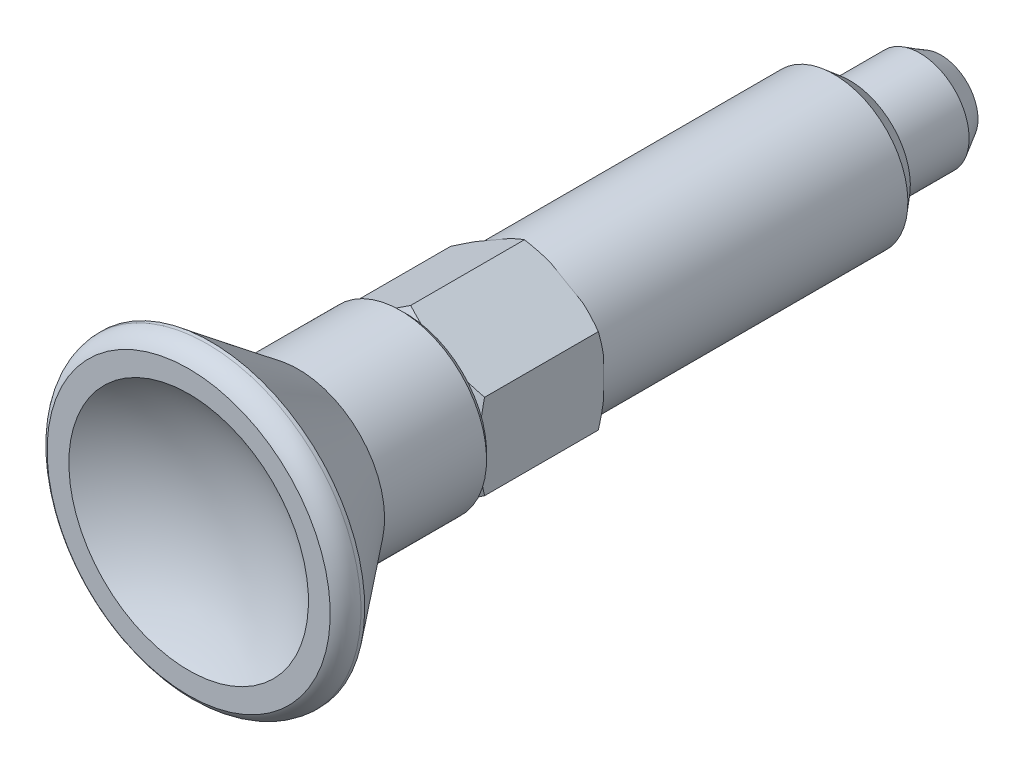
ISO-10303-21;
HEADER;
FILE_DESCRIPTION(('STEP AP214'),'2;1');
FILE_NAME('part.step','',(''),(''),'','','');
FILE_SCHEMA(('AUTOMOTIVE_DESIGN { 1 0 10303 214 1 1 1 1 }'));
ENDSEC;
DATA;
#1=APPLICATION_CONTEXT('core data for automotive mechanical design processes');
#2=APPLICATION_PROTOCOL_DEFINITION('international standard','automotive_design',2000,#1);
#3=PRODUCT_CONTEXT('',#1,'mechanical');
#4=PRODUCT('Part','Part','',(#3));
#5=PRODUCT_RELATED_PRODUCT_CATEGORY('part','',(#4));
#6=PRODUCT_DEFINITION_FORMATION('','',#4);
#7=PRODUCT_DEFINITION_CONTEXT('part definition',#1,'design');
#8=PRODUCT_DEFINITION('design','',#6,#7);
#9=PRODUCT_DEFINITION_SHAPE('','',#8);
#10=(LENGTH_UNIT() NAMED_UNIT(*) SI_UNIT(.MILLI.,.METRE.));
#11=(NAMED_UNIT(*) PLANE_ANGLE_UNIT() SI_UNIT($,.RADIAN.));
#12=(NAMED_UNIT(*) SI_UNIT($,.STERADIAN.) SOLID_ANGLE_UNIT());
#13=UNCERTAINTY_MEASURE_WITH_UNIT(LENGTH_MEASURE(1.E-05),#10,'distance_accuracy_value','');
#14=(GEOMETRIC_REPRESENTATION_CONTEXT(3) GLOBAL_UNCERTAINTY_ASSIGNED_CONTEXT((#13)) GLOBAL_UNIT_ASSIGNED_CONTEXT((#10,
#11,#12)) REPRESENTATION_CONTEXT('',''));
#15=CARTESIAN_POINT('',(0.,0.,0.));
#16=DIRECTION('',(0.,0.,1.));
#17=DIRECTION('',(1.,0.,0.));
#18=AXIS2_PLACEMENT_3D('',#15,#16,#17);
#19=CARTESIAN_POINT('',(0.,0.,-26.));
#20=DIRECTION('',(0.,0.,1.));
#21=DIRECTION('',(0.,-1.,0.));
#22=AXIS2_PLACEMENT_3D('',#19,#20,#21);
#23=CYLINDRICAL_SURFACE('',#22,6.);
#24=CARTESIAN_POINT('',(0.,0.,0.));
#25=DIRECTION('',(0.,0.,1.));
#26=DIRECTION('',(0.,-1.,0.));
#27=AXIS2_PLACEMENT_3D('',#24,#25,#26);
#28=CIRCLE('',#27,6.);
#29=CARTESIAN_POINT('',(-3.,5.19615242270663,0.));
#30=VERTEX_POINT('',#29);
#31=CARTESIAN_POINT('',(-6.,0.,0.));
#32=VERTEX_POINT('',#31);
#33=EDGE_CURVE('E350',#30,#32,#28,.T.);
#34=ORIENTED_EDGE('',*,*,#33,.F.);
#35=CARTESIAN_POINT('',(0.,0.,0.));
#36=DIRECTION('',(0.,0.,1.));
#37=DIRECTION('',(0.,-1.,0.));
#38=AXIS2_PLACEMENT_3D('',#35,#36,#37);
#39=CIRCLE('',#38,6.);
#40=CARTESIAN_POINT('',(3.,5.19615242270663,0.));
#41=VERTEX_POINT('',#40);
#42=EDGE_CURVE('E344',#41,#30,#39,.T.);
#43=ORIENTED_EDGE('',*,*,#42,.F.);
#44=CARTESIAN_POINT('',(0.,0.,0.));
#45=DIRECTION('',(0.,0.,1.));
#46=DIRECTION('',(0.,-1.,0.));
#47=AXIS2_PLACEMENT_3D('',#44,#45,#46);
#48=CIRCLE('',#47,6.);
#49=CARTESIAN_POINT('',(6.,0.,0.));
#50=VERTEX_POINT('',#49);
#51=EDGE_CURVE('E181',#50,#41,#48,.T.);
#52=ORIENTED_EDGE('',*,*,#51,.F.);
#53=CARTESIAN_POINT('',(0.,0.,0.));
#54=DIRECTION('',(0.,0.,1.));
#55=DIRECTION('',(0.,-1.,0.));
#56=AXIS2_PLACEMENT_3D('',#53,#54,#55);
#57=CIRCLE('',#56,6.);
#58=CARTESIAN_POINT('',(3.,-5.19615242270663,0.));
#59=VERTEX_POINT('',#58);
#60=EDGE_CURVE('E177',#59,#50,#57,.T.);
#61=ORIENTED_EDGE('',*,*,#60,.F.);
#62=CARTESIAN_POINT('',(0.,0.,0.));
#63=DIRECTION('',(0.,0.,1.));
#64=DIRECTION('',(0.,-1.,0.));
#65=AXIS2_PLACEMENT_3D('',#62,#63,#64);
#66=CIRCLE('',#65,6.);
#67=CARTESIAN_POINT('',(-3.,-5.19615242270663,0.));
#68=VERTEX_POINT('',#67);
#69=EDGE_CURVE('E157',#68,#59,#66,.T.);
#70=ORIENTED_EDGE('',*,*,#69,.F.);
#71=CARTESIAN_POINT('',(0.,0.,0.));
#72=DIRECTION('',(0.,0.,1.));
#73=DIRECTION('',(0.,-1.,0.));
#74=AXIS2_PLACEMENT_3D('',#71,#72,#73);
#75=CIRCLE('',#74,6.);
#76=EDGE_CURVE('E198',#32,#68,#75,.T.);
#77=ORIENTED_EDGE('',*,*,#76,.F.);
#78=EDGE_LOOP('',(#34,#43,#52,#61,#70,#77));
#79=FACE_BOUND('',#78,.T.);
#80=CARTESIAN_POINT('',(0.,0.,-24.7265));
#81=DIRECTION('',(0.,0.,1.));
#82=DIRECTION('',(0.,-1.,0.));
#83=AXIS2_PLACEMENT_3D('',#80,#81,#82);
#84=CIRCLE('',#83,6.);
#85=CARTESIAN_POINT('',(0.,-6.,-24.7265));
#86=VERTEX_POINT('',#85);
#87=EDGE_CURVE('E191',#86,#86,#84,.T.);
#88=ORIENTED_EDGE('',*,*,#87,.T.);
#89=EDGE_LOOP('',(#88));
#90=FACE_BOUND('',#89,.T.);
#91=ADVANCED_FACE('F14',(#79,#90),#23,.T.);
#92=CARTESIAN_POINT('',(6.,0.,0.));
#93=DIRECTION('',(0.,0.,-1.));
#94=DIRECTION('',(0.,1.,0.));
#95=AXIS2_PLACEMENT_3D('',#92,#93,#94);
#96=PLANE('',#95);
#97=CARTESIAN_POINT('',(0.,0.,2.66817817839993E-11));
#98=DIRECTION('',(0.,0.,1.));
#99=DIRECTION('',(0.,-1.,0.));
#100=AXIS2_PLACEMENT_3D('',#97,#98,#99);
#101=CIRCLE('',#100,6.1999999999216);
#102=CARTESIAN_POINT('',(-1.64722507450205,-5.97717739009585,1.33417582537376E-11));
#103=VERTEX_POINT('',#102);
#104=CARTESIAN_POINT('',(1.64722507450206,-5.97717739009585,1.33417582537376E-11));
#105=VERTEX_POINT('',#104);
#106=EDGE_CURVE('E336',#103,#105,#101,.T.);
#107=ORIENTED_EDGE('',*,*,#106,.F.);
#108=DIRECTION('',(-0.866025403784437,0.5,0.));
#109=VECTOR('',#108,1.);
#110=CARTESIAN_POINT('',(-1.64722507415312,-5.97717739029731,0.));
#111=LINE('',#110,#109);
#112=EDGE_CURVE('E172',#103,#68,#111,.T.);
#113=ORIENTED_EDGE('',*,*,#112,.T.);
#114=ORIENTED_EDGE('',*,*,#69,.T.);
#115=DIRECTION('',(-0.866025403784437,-0.5,0.));
#116=VECTOR('',#115,1.);
#117=CARTESIAN_POINT('',(3.,-5.19615242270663,0.));
#118=LINE('',#117,#116);
#119=EDGE_CURVE('E162',#59,#105,#118,.T.);
#120=ORIENTED_EDGE('',*,*,#119,.T.);
#121=EDGE_LOOP('',(#107,#113,#114,#120));
#122=FACE_BOUND('',#121,.T.);
#123=ADVANCED_FACE('F190',(#122),#96,.T.);
#124=CARTESIAN_POINT('',(6.,0.,0.));
#125=DIRECTION('',(0.,0.,-1.));
#126=DIRECTION('',(0.,1.,0.));
#127=AXIS2_PLACEMENT_3D('',#124,#125,#126);
#128=PLANE('',#127);
#129=ORIENTED_EDGE('',*,*,#76,.T.);
#130=DIRECTION('',(-0.866025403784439,0.5,0.));
#131=VECTOR('',#130,1.);
#132=CARTESIAN_POINT('',(-3.,-5.19615242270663,0.));
#133=LINE('',#132,#131);
#134=CARTESIAN_POINT('',(-4.35277492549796,-4.41512745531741,1.33417582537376E-11));
#135=VERTEX_POINT('',#134);
#136=EDGE_CURVE('E351',#68,#135,#133,.T.);
#137=ORIENTED_EDGE('',*,*,#136,.T.);
#138=CARTESIAN_POINT('',(0.,0.,2.66817817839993E-11));
#139=DIRECTION('',(0.,0.,1.));
#140=DIRECTION('',(0.,-1.,0.));
#141=AXIS2_PLACEMENT_3D('',#138,#139,#140);
#142=CIRCLE('',#141,6.1999999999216);
#143=CARTESIAN_POINT('',(-6.,-1.56204993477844,1.33417582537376E-11));
#144=VERTEX_POINT('',#143);
#145=EDGE_CURVE('E562',#144,#135,#142,.T.);
#146=ORIENTED_EDGE('',*,*,#145,.F.);
#147=DIRECTION('',(0.,1.,0.));
#148=VECTOR('',#147,1.);
#149=CARTESIAN_POINT('',(-6.,0.,0.));
#150=LINE('',#149,#148);
#151=EDGE_CURVE('E353',#144,#32,#150,.T.);
#152=ORIENTED_EDGE('',*,*,#151,.T.);
#153=EDGE_LOOP('',(#129,#137,#146,#152));
#154=FACE_BOUND('',#153,.T.);
#155=ADVANCED_FACE('F359',(#154),#128,.T.);
#156=CARTESIAN_POINT('',(6.,0.,0.));
#157=DIRECTION('',(0.,0.,-1.));
#158=DIRECTION('',(0.,1.,0.));
#159=AXIS2_PLACEMENT_3D('',#156,#157,#158);
#160=PLANE('',#159);
#161=CARTESIAN_POINT('',(0.,0.,2.66817817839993E-11));
#162=DIRECTION('',(0.,0.,1.));
#163=DIRECTION('',(0.,-1.,0.));
#164=AXIS2_PLACEMENT_3D('',#161,#162,#163);
#165=CIRCLE('',#164,6.1999999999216);
#166=CARTESIAN_POINT('',(-4.35277492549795,4.41512745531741,1.33417582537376E-11));
#167=VERTEX_POINT('',#166);
#168=CARTESIAN_POINT('',(-6.,1.56204993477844,1.33417582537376E-11));
#169=VERTEX_POINT('',#168);
#170=EDGE_CURVE('E557',#167,#169,#165,.T.);
#171=ORIENTED_EDGE('',*,*,#170,.F.);
#172=DIRECTION('',(0.866025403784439,0.5,0.));
#173=VECTOR('',#172,1.);
#174=CARTESIAN_POINT('',(-4.35277492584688,4.41512745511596,0.));
#175=LINE('',#174,#173);
#176=EDGE_CURVE('E345',#167,#30,#175,.T.);
#177=ORIENTED_EDGE('',*,*,#176,.T.);
#178=ORIENTED_EDGE('',*,*,#33,.T.);
#179=DIRECTION('',(0.,1.,0.));
#180=VECTOR('',#179,1.);
#181=CARTESIAN_POINT('',(-6.,0.,0.));
#182=LINE('',#181,#180);
#183=EDGE_CURVE('E348',#32,#169,#182,.T.);
#184=ORIENTED_EDGE('',*,*,#183,.T.);
#185=EDGE_LOOP('',(#171,#177,#178,#184));
#186=FACE_BOUND('',#185,.T.);
#187=ADVANCED_FACE('F570',(#186),#160,.T.);
#188=CARTESIAN_POINT('',(6.,0.,0.));
#189=DIRECTION('',(0.,0.,-1.));
#190=DIRECTION('',(0.,1.,0.));
#191=AXIS2_PLACEMENT_3D('',#188,#189,#190);
#192=PLANE('',#191);
#193=CARTESIAN_POINT('',(0.,0.,2.66835165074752E-11));
#194=DIRECTION('',(0.,0.,1.));
#195=DIRECTION('',(0.,-1.,0.));
#196=AXIS2_PLACEMENT_3D('',#193,#194,#195);
#197=CIRCLE('',#196,6.1999999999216);
#198=CARTESIAN_POINT('',(1.64722507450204,5.97717739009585,1.33417582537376E-11));
#199=VERTEX_POINT('',#198);
#200=CARTESIAN_POINT('',(-1.64722507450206,5.97717739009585,1.33417582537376E-11));
#201=VERTEX_POINT('',#200);
#202=EDGE_CURVE('E553',#199,#201,#197,.T.);
#203=ORIENTED_EDGE('',*,*,#202,.F.);
#204=DIRECTION('',(0.866025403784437,-0.5,0.));
#205=VECTOR('',#204,1.);
#206=CARTESIAN_POINT('',(1.64722507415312,5.97717739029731,0.));
#207=LINE('',#206,#205);
#208=EDGE_CURVE('E187',#199,#41,#207,.T.);
#209=ORIENTED_EDGE('',*,*,#208,.T.);
#210=ORIENTED_EDGE('',*,*,#42,.T.);
#211=DIRECTION('',(0.866025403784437,0.5,0.));
#212=VECTOR('',#211,1.);
#213=CARTESIAN_POINT('',(-3.,5.19615242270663,0.));
#214=LINE('',#213,#212);
#215=EDGE_CURVE('E342',#30,#201,#214,.T.);
#216=ORIENTED_EDGE('',*,*,#215,.T.);
#217=EDGE_LOOP('',(#203,#209,#210,#216));
#218=FACE_BOUND('',#217,.T.);
#219=ADVANCED_FACE('F663',(#218),#192,.T.);
#220=CARTESIAN_POINT('',(6.,0.,0.));
#221=DIRECTION('',(0.,0.,-1.));
#222=DIRECTION('',(0.,1.,0.));
#223=AXIS2_PLACEMENT_3D('',#220,#221,#222);
#224=PLANE('',#223);
#225=CARTESIAN_POINT('',(0.,0.,2.66817817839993E-11));
#226=DIRECTION('',(0.,0.,1.));
#227=DIRECTION('',(0.,-1.,0.));
#228=AXIS2_PLACEMENT_3D('',#225,#226,#227);
#229=CIRCLE('',#228,6.1999999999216);
#230=CARTESIAN_POINT('',(4.35277492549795,-4.41512745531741,1.33417582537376E-11));
#231=VERTEX_POINT('',#230);
#232=CARTESIAN_POINT('',(6.,-1.56204993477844,1.33417582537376E-11));
#233=VERTEX_POINT('',#232);
#234=EDGE_CURVE('E179',#231,#233,#229,.T.);
#235=ORIENTED_EDGE('',*,*,#234,.F.);
#236=DIRECTION('',(-0.866025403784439,-0.5,0.));
#237=VECTOR('',#236,1.);
#238=CARTESIAN_POINT('',(4.35277492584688,-4.41512745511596,0.));
#239=LINE('',#238,#237);
#240=EDGE_CURVE('E165',#231,#59,#239,.T.);
#241=ORIENTED_EDGE('',*,*,#240,.T.);
#242=ORIENTED_EDGE('',*,*,#60,.T.);
#243=DIRECTION('',(0.,1.,0.));
#244=VECTOR('',#243,1.);
#245=CARTESIAN_POINT('',(6.,0.,0.));
#246=LINE('',#245,#244);
#247=EDGE_CURVE('E182',#50,#233,#246,.F.);
#248=ORIENTED_EDGE('',*,*,#247,.T.);
#249=EDGE_LOOP('',(#235,#241,#242,#248));
#250=FACE_BOUND('',#249,.T.);
#251=ADVANCED_FACE('F176',(#250),#224,.T.);
#252=CARTESIAN_POINT('',(6.,0.,0.));
#253=DIRECTION('',(0.,0.,-1.));
#254=DIRECTION('',(0.,1.,0.));
#255=AXIS2_PLACEMENT_3D('',#252,#253,#254);
#256=PLANE('',#255);
#257=CARTESIAN_POINT('',(0.,0.,2.66817817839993E-11));
#258=DIRECTION('',(0.,0.,1.));
#259=DIRECTION('',(0.,-1.,0.));
#260=AXIS2_PLACEMENT_3D('',#257,#258,#259);
#261=CIRCLE('',#260,6.1999999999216);
#262=CARTESIAN_POINT('',(6.,1.56204993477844,1.33417582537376E-11));
#263=VERTEX_POINT('',#262);
#264=CARTESIAN_POINT('',(4.35277492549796,4.41512745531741,1.33417582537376E-11));
#265=VERTEX_POINT('',#264);
#266=EDGE_CURVE('E552',#263,#265,#261,.T.);
#267=ORIENTED_EDGE('',*,*,#266,.F.);
#268=DIRECTION('',(0.,1.,0.));
#269=VECTOR('',#268,1.);
#270=CARTESIAN_POINT('',(6.,0.,0.));
#271=LINE('',#270,#269);
#272=EDGE_CURVE('E333',#263,#50,#271,.F.);
#273=ORIENTED_EDGE('',*,*,#272,.T.);
#274=ORIENTED_EDGE('',*,*,#51,.T.);
#275=DIRECTION('',(0.866025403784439,-0.5,0.));
#276=VECTOR('',#275,1.);
#277=CARTESIAN_POINT('',(3.,5.19615242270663,0.));
#278=LINE('',#277,#276);
#279=EDGE_CURVE('E337',#41,#265,#278,.T.);
#280=ORIENTED_EDGE('',*,*,#279,.T.);
#281=EDGE_LOOP('',(#267,#273,#274,#280));
#282=FACE_BOUND('',#281,.T.);
#283=ADVANCED_FACE('F666',(#282),#256,.T.);
#284=CARTESIAN_POINT('',(0.,0.,0.422950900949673));
#285=DIRECTION('',(0.,0.,1.));
#286=DIRECTION('',(0.,-1.,0.));
#287=AXIS2_PLACEMENT_3D('',#284,#285,#286);
#288=CONICAL_SURFACE('',#287,6.93257244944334,1.04719755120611);
#289=CARTESIAN_POINT('',(1.85171461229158E-11,-6.9282032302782,0.420428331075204));
#290=CARTESIAN_POINT('',(0.135229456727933,-6.8501284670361,0.375356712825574));
#291=CARTESIAN_POINT('',(0.270999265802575,-6.7717417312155,0.332381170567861));
#292=CARTESIAN_POINT('',(0.543450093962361,-6.61444217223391,0.251283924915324));
#293=CARTESIAN_POINT('',(0.680129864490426,-6.53553006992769,0.213156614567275));
#294=CARTESIAN_POINT('',(0.954573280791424,-6.37708008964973,0.142302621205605));
#295=CARTESIAN_POINT('',(1.0923371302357,-6.29754209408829,0.109576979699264));
#296=CARTESIAN_POINT('',(1.36899477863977,-6.13781372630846,0.0501190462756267));
#297=CARTESIAN_POINT('',(1.5078897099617,-6.05762270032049,0.0233938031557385));
#298=CARTESIAN_POINT('',(1.64722507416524,-5.9771773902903,6.99110908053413E-11));
#299=B_SPLINE_CURVE_WITH_KNOTS('',3,(#289,#290,#291,#292,#293,#294,#295,#296,#297,#298),
.UNSPECIFIED.,.F.,.F.,(4,2,2,2,4),(0.,0.487584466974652,0.974599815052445,1.46170895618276,
1.94938735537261),.UNSPECIFIED.);
#300=CARTESIAN_POINT('',(7.23850724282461E-12,-6.92820323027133,0.420428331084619));
#301=VERTEX_POINT('',#300);
#302=EDGE_CURVE('E168',#301,#105,#299,.T.);
#303=ORIENTED_EDGE('',*,*,#302,.F.);
#304=CARTESIAN_POINT('',(-1.64722507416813,-5.97717739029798,6.52793791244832E-11));
#305=CARTESIAN_POINT('',(-1.50788970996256,-6.05762270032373,0.0233938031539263));
#306=CARTESIAN_POINT('',(-1.3689947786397,-6.13781372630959,0.0501190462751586));
#307=CARTESIAN_POINT('',(-1.0923371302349,-6.29754209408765,0.10957697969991));
#308=CARTESIAN_POINT('',(-0.954573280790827,-6.37708008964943,0.142302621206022));
#309=CARTESIAN_POINT('',(-0.680129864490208,-6.53553006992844,0.213156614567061));
#310=CARTESIAN_POINT('',(-0.543450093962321,-6.61444217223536,0.251283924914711));
#311=CARTESIAN_POINT('',(-0.27099926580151,-6.77174173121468,0.332381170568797));
#312=CARTESIAN_POINT('',(-0.135229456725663,-6.85012846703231,0.375356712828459));
#313=CARTESIAN_POINT('',(-1.36344642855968E-11,-6.92820323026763,0.420428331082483));
#314=B_SPLINE_CURVE_WITH_KNOTS('',3,(#304,#305,#306,#307,#308,#309,#310,#311,#312,#313),
.UNSPECIFIED.,.F.,.F.,(4,2,2,2,4),(0.,0.487678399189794,0.974787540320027,1.46180288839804,
1.94938735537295),.UNSPECIFIED.);
#315=EDGE_CURVE('E371',#103,#301,#314,.T.);
#316=ORIENTED_EDGE('',*,*,#315,.F.);
#317=ORIENTED_EDGE('',*,*,#106,.T.);
#318=EDGE_LOOP('',(#303,#316,#317));
#319=FACE_BOUND('',#318,.T.);
#320=ADVANCED_FACE('F401',(#319),#288,.T.);
#321=CARTESIAN_POINT('',(0.,0.,0.422950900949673));
#322=DIRECTION('',(0.,0.,1.));
#323=DIRECTION('',(0.,-1.,0.));
#324=AXIS2_PLACEMENT_3D('',#321,#322,#323);
#325=CONICAL_SURFACE('',#324,6.93257244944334,1.04719755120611);
#326=CARTESIAN_POINT('',(-6.00000000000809,-1.56204993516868,6.52828485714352E-11));
#327=CARTESIAN_POINT('',(-6.00000000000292,-1.72294055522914,0.0233938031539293));
#328=CARTESIAN_POINT('',(-6.00000000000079,-1.88332260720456,0.0501190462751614));
#329=CARTESIAN_POINT('',(-5.99999999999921,-2.20277934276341,0.109576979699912));
#330=CARTESIAN_POINT('',(-5.99999999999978,-2.361855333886,0.142302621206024));
#331=CARTESIAN_POINT('',(-6.00000000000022,-2.67875529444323,0.213156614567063));
#332=CARTESIAN_POINT('',(-6.00000000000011,-2.83657949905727,0.251283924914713));
#333=CARTESIAN_POINT('',(-5.99999999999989,-3.1511786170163,0.332381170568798));
#334=CARTESIAN_POINT('',(-5.99999999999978,-3.30795208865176,0.37535671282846));
#335=CARTESIAN_POINT('',(-6.,-3.464101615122,0.420428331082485));
#336=B_SPLINE_CURVE_WITH_KNOTS('',3,(#326,#327,#328,#329,#330,#331,#332,#333,#334,#335),
.UNSPECIFIED.,.F.,.F.,(4,2,2,2,4),(0.,0.487678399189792,0.974787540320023,1.46180288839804,
1.94938735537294),.UNSPECIFIED.);
#337=CARTESIAN_POINT('',(-5.99999999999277,-3.46410161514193,0.420428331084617));
#338=VERTEX_POINT('',#337);
#339=EDGE_CURVE('E408',#144,#338,#336,.T.);
#340=ORIENTED_EDGE('',*,*,#339,.F.);
#341=ORIENTED_EDGE('',*,*,#145,.T.);
#342=CARTESIAN_POINT('',(-5.99999999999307,-3.46410161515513,0.420428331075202));
#343=CARTESIAN_POINT('',(-5.86477054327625,-3.5421763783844,0.375356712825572));
#344=CARTESIAN_POINT('',(-5.72900073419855,-3.62056311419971,0.332381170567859));
#345=CARTESIAN_POINT('',(-5.45654990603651,-3.7778626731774,0.251283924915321));
#346=CARTESIAN_POINT('',(-5.31987013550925,-3.85677477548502,0.213156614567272));
#347=CARTESIAN_POINT('',(-5.04542671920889,-4.01522475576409,0.142302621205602));
#348=CARTESIAN_POINT('',(-4.90766286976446,-4.09476275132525,0.109576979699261));
#349=CARTESIAN_POINT('',(-4.63100522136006,-4.25449111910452,0.0501190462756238));
#350=CARTESIAN_POINT('',(-4.49211029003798,-4.33468214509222,0.0233938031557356));
#351=CARTESIAN_POINT('',(-4.35277492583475,-4.41512745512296,6.99076213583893E-11));
#352=B_SPLINE_CURVE_WITH_KNOTS('',3,(#342,#343,#344,#345,#346,#347,#348,#349,#350,#351),
.UNSPECIFIED.,.F.,.F.,(4,2,2,2,4),(0.,0.487584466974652,0.974599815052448,1.46170895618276,
1.94938735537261),.UNSPECIFIED.);
#353=EDGE_CURVE('E367',#338,#135,#352,.T.);
#354=ORIENTED_EDGE('',*,*,#353,.F.);
#355=EDGE_LOOP('',(#340,#341,#354));
#356=FACE_BOUND('',#355,.T.);
#357=ADVANCED_FACE('F396',(#356),#325,.T.);
#358=CARTESIAN_POINT('',(0.,0.,0.422950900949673));
#359=DIRECTION('',(0.,0.,1.));
#360=DIRECTION('',(0.,-1.,0.));
#361=AXIS2_PLACEMENT_3D('',#358,#359,#360);
#362=CONICAL_SURFACE('',#361,6.93257244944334,1.04719755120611);
#363=CARTESIAN_POINT('',(-6.00000000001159,3.46410161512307,0.420428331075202));
#364=CARTESIAN_POINT('',(-6.00000000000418,3.30795208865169,0.375356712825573));
#365=CARTESIAN_POINT('',(-6.00000000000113,3.15117861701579,0.332381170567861));
#366=CARTESIAN_POINT('',(-5.99999999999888,2.83657949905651,0.251283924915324));
#367=CARTESIAN_POINT('',(-5.99999999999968,2.67875529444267,0.213156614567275));
#368=CARTESIAN_POINT('',(-6.00000000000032,2.36185533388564,0.142302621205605));
#369=CARTESIAN_POINT('',(-6.00000000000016,2.20277934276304,0.109576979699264));
#370=CARTESIAN_POINT('',(-5.99999999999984,1.88332260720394,0.0501190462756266));
#371=CARTESIAN_POINT('',(-5.99999999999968,1.72294055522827,0.0233938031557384));
#372=CARTESIAN_POINT('',(-6.,1.56204993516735,6.99110908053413E-11));
#373=B_SPLINE_CURVE_WITH_KNOTS('',3,(#363,#364,#365,#366,#367,#368,#369,#370,#371,#372),
.UNSPECIFIED.,.F.,.F.,(4,2,2,2,4),(0.,0.487584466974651,0.974599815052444,1.46170895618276,
1.9493873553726),.UNSPECIFIED.);
#374=CARTESIAN_POINT('',(-6.,3.4641016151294,0.420428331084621));
#375=VERTEX_POINT('',#374);
#376=EDGE_CURVE('E416',#375,#169,#373,.T.);
#377=ORIENTED_EDGE('',*,*,#376,.F.);
#378=CARTESIAN_POINT('',(-4.35277492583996,4.4151274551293,6.52828485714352E-11));
#379=CARTESIAN_POINT('',(-4.49211029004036,4.3346821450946,0.0233938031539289));
#380=CARTESIAN_POINT('',(-4.63100522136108,4.25449111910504,0.0501190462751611));
#381=CARTESIAN_POINT('',(-4.90766286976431,4.09476275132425,0.109576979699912));
#382=CARTESIAN_POINT('',(-5.04542671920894,4.01522475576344,0.142302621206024));
#383=CARTESIAN_POINT('',(-5.31987013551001,3.85677477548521,0.213156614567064));
#384=CARTESIAN_POINT('',(-5.45654990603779,3.7778626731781,0.251283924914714));
#385=CARTESIAN_POINT('',(-5.72900073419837,3.62056311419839,0.332381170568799));
#386=CARTESIAN_POINT('',(-5.86477054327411,3.54217637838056,0.375356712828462));
#387=CARTESIAN_POINT('',(-5.99999999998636,3.46410161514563,0.420428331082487));
#388=B_SPLINE_CURVE_WITH_KNOTS('',3,(#378,#379,#380,#381,#382,#383,#384,#385,#386,#387),
.UNSPECIFIED.,.F.,.F.,(4,2,2,2,4),(0.,0.487678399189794,0.974787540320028,1.46180288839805,
1.94938735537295),.UNSPECIFIED.);
#389=EDGE_CURVE('E576',#167,#375,#388,.T.);
#390=ORIENTED_EDGE('',*,*,#389,.F.);
#391=ORIENTED_EDGE('',*,*,#170,.T.);
#392=EDGE_LOOP('',(#377,#390,#391));
#393=FACE_BOUND('',#392,.T.);
#394=ADVANCED_FACE('F400',(#393),#362,.T.);
#395=CARTESIAN_POINT('',(0.,0.,0.422950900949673));
#396=DIRECTION('',(0.,0.,1.));
#397=DIRECTION('',(0.,-1.,0.));
#398=AXIS2_PLACEMENT_3D('',#395,#396,#397);
#399=CONICAL_SURFACE('',#398,6.93257244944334,1.04719755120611);
#400=CARTESIAN_POINT('',(-1.8517625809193E-11,6.9282032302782,0.420428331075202));
#401=CARTESIAN_POINT('',(-0.135229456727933,6.8501284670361,0.375356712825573));
#402=CARTESIAN_POINT('',(-0.270999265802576,6.7717417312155,0.332381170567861));
#403=CARTESIAN_POINT('',(-0.543450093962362,6.61444217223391,0.251283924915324));
#404=CARTESIAN_POINT('',(-0.680129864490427,6.53553006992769,0.213156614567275));
#405=CARTESIAN_POINT('',(-0.954573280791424,6.37708008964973,0.142302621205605));
#406=CARTESIAN_POINT('',(-1.0923371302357,6.29754209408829,0.109576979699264));
#407=CARTESIAN_POINT('',(-1.36899477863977,6.13781372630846,0.0501190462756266));
#408=CARTESIAN_POINT('',(-1.5078897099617,6.05762270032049,0.0233938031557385));
#409=CARTESIAN_POINT('',(-1.64722507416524,5.9771773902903,6.99110908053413E-11));
#410=B_SPLINE_CURVE_WITH_KNOTS('',3,(#400,#401,#402,#403,#404,#405,#406,#407,#408,#409),
.UNSPECIFIED.,.F.,.F.,(4,2,2,2,4),(0.,0.487584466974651,0.974599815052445,1.46170895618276,
1.9493873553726),.UNSPECIFIED.);
#411=CARTESIAN_POINT('',(-7.23872023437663E-12,6.92820323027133,0.420428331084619));
#412=VERTEX_POINT('',#411);
#413=EDGE_CURVE('E578',#412,#201,#410,.T.);
#414=ORIENTED_EDGE('',*,*,#413,.F.);
#415=CARTESIAN_POINT('',(1.64722507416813,5.97717739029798,6.52793791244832E-11));
#416=CARTESIAN_POINT('',(1.50788970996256,6.05762270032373,0.0233938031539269));
#417=CARTESIAN_POINT('',(1.3689947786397,6.13781372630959,0.0501190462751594));
#418=CARTESIAN_POINT('',(1.0923371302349,6.29754209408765,0.109576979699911));
#419=CARTESIAN_POINT('',(0.954573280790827,6.37708008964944,0.142302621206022));
#420=CARTESIAN_POINT('',(0.680129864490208,6.53553006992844,0.213156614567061));
#421=CARTESIAN_POINT('',(0.543450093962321,6.61444217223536,0.251283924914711));
#422=CARTESIAN_POINT('',(0.27099926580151,6.77174173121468,0.332381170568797));
#423=CARTESIAN_POINT('',(0.135229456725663,6.85012846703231,0.375356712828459));
#424=CARTESIAN_POINT('',(1.36340649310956E-11,6.92820323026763,0.420428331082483));
#425=B_SPLINE_CURVE_WITH_KNOTS('',3,(#415,#416,#417,#418,#419,#420,#421,#422,#423,#424),
.UNSPECIFIED.,.F.,.F.,(4,2,2,2,4),(0.,0.487678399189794,0.974787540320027,1.46180288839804,
1.94938735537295),.UNSPECIFIED.);
#426=EDGE_CURVE('E632',#199,#412,#425,.T.);
#427=ORIENTED_EDGE('',*,*,#426,.F.);
#428=ORIENTED_EDGE('',*,*,#202,.T.);
#429=EDGE_LOOP('',(#414,#427,#428));
#430=FACE_BOUND('',#429,.T.);
#431=ADVANCED_FACE('F509',(#430),#399,.T.);
#432=CARTESIAN_POINT('',(0.,0.,0.422950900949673));
#433=DIRECTION('',(0.,0.,1.));
#434=DIRECTION('',(0.,-1.,0.));
#435=AXIS2_PLACEMENT_3D('',#432,#433,#434);
#436=CONICAL_SURFACE('',#435,6.93257244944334,1.04719755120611);
#437=CARTESIAN_POINT('',(6.00000000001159,-3.46410161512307,0.420428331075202));
#438=CARTESIAN_POINT('',(6.00000000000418,-3.30795208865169,0.375356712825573));
#439=CARTESIAN_POINT('',(6.00000000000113,-3.15117861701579,0.332381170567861));
#440=CARTESIAN_POINT('',(5.99999999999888,-2.83657949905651,0.251283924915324));
#441=CARTESIAN_POINT('',(5.99999999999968,-2.67875529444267,0.213156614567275));
#442=CARTESIAN_POINT('',(6.00000000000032,-2.36185533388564,0.142302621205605));
#443=CARTESIAN_POINT('',(6.00000000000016,-2.20277934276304,0.109576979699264));
#444=CARTESIAN_POINT('',(5.99999999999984,-1.88332260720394,0.0501190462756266));
#445=CARTESIAN_POINT('',(5.99999999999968,-1.72294055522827,0.0233938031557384));
#446=CARTESIAN_POINT('',(6.,-1.56204993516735,6.99110908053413E-11));
#447=B_SPLINE_CURVE_WITH_KNOTS('',3,(#437,#438,#439,#440,#441,#442,#443,#444,#445,#446),
.UNSPECIFIED.,.F.,.F.,(4,2,2,2,4),(0.,0.487584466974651,0.974599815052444,1.46170895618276,
1.9493873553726),.UNSPECIFIED.);
#448=CARTESIAN_POINT('',(5.99999999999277,-3.46410161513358,0.420428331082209));
#449=VERTEX_POINT('',#448);
#450=EDGE_CURVE('E307',#449,#233,#447,.T.);
#451=ORIENTED_EDGE('',*,*,#450,.F.);
#452=CARTESIAN_POINT('',(4.35277492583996,-4.4151274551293,6.52845832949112E-11));
#453=CARTESIAN_POINT('',(4.49211029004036,-4.3346821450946,0.0233938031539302));
#454=CARTESIAN_POINT('',(4.63100522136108,-4.25449111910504,0.0501190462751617));
#455=CARTESIAN_POINT('',(4.90766286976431,-4.09476275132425,0.109576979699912));
#456=CARTESIAN_POINT('',(5.04542671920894,-4.01522475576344,0.142302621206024));
#457=CARTESIAN_POINT('',(5.31987013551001,-3.85677477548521,0.213156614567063));
#458=CARTESIAN_POINT('',(5.45654990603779,-3.7778626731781,0.251283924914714));
#459=CARTESIAN_POINT('',(5.72900073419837,-3.62056311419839,0.3323811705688));
#460=CARTESIAN_POINT('',(5.86477054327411,-3.54217637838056,0.375356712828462));
#461=CARTESIAN_POINT('',(5.99999999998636,-3.46410161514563,0.420428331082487));
#462=B_SPLINE_CURVE_WITH_KNOTS('',3,(#452,#453,#454,#455,#456,#457,#458,#459,#460,#461),
.UNSPECIFIED.,.F.,.F.,(4,2,2,2,4),(0.,0.487678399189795,0.974787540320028,1.46180288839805,
1.94938735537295),.UNSPECIFIED.);
#463=EDGE_CURVE('E515',#231,#449,#462,.T.);
#464=ORIENTED_EDGE('',*,*,#463,.F.);
#465=ORIENTED_EDGE('',*,*,#234,.T.);
#466=EDGE_LOOP('',(#451,#464,#465));
#467=FACE_BOUND('',#466,.T.);
#468=ADVANCED_FACE('F505',(#467),#436,.T.);
#469=CARTESIAN_POINT('',(0.,0.,0.422950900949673));
#470=DIRECTION('',(0.,0.,1.));
#471=DIRECTION('',(0.,-1.,0.));
#472=AXIS2_PLACEMENT_3D('',#469,#470,#471);
#473=CONICAL_SURFACE('',#472,6.93257244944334,1.04719755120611);
#474=CARTESIAN_POINT('',(5.99999999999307,3.46410161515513,0.420428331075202));
#475=CARTESIAN_POINT('',(5.86477054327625,3.5421763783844,0.375356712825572));
#476=CARTESIAN_POINT('',(5.72900073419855,3.62056311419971,0.332381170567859));
#477=CARTESIAN_POINT('',(5.45654990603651,3.7778626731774,0.251283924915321));
#478=CARTESIAN_POINT('',(5.31987013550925,3.85677477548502,0.213156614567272));
#479=CARTESIAN_POINT('',(5.04542671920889,4.01522475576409,0.142302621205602));
#480=CARTESIAN_POINT('',(4.90766286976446,4.09476275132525,0.109576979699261));
#481=CARTESIAN_POINT('',(4.63100522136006,4.25449111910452,0.0501190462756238));
#482=CARTESIAN_POINT('',(4.49211029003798,4.33468214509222,0.0233938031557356));
#483=CARTESIAN_POINT('',(4.35277492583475,4.41512745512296,6.99076213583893E-11));
#484=B_SPLINE_CURVE_WITH_KNOTS('',3,(#474,#475,#476,#477,#478,#479,#480,#481,#482,#483),
.UNSPECIFIED.,.F.,.F.,(4,2,2,2,4),(0.,0.487584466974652,0.974599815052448,1.46170895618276,
1.94938735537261),.UNSPECIFIED.);
#485=CARTESIAN_POINT('',(5.99999999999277,3.46410161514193,0.420428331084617));
#486=VERTEX_POINT('',#485);
#487=EDGE_CURVE('E631',#486,#265,#484,.T.);
#488=ORIENTED_EDGE('',*,*,#487,.F.);
#489=CARTESIAN_POINT('',(6.00000000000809,1.56204993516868,6.52845832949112E-11));
#490=CARTESIAN_POINT('',(6.00000000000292,1.72294055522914,0.0233938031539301));
#491=CARTESIAN_POINT('',(6.00000000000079,1.88332260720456,0.0501190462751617));
#492=CARTESIAN_POINT('',(5.99999999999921,2.20277934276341,0.109576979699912));
#493=CARTESIAN_POINT('',(5.99999999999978,2.361855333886,0.142302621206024));
#494=CARTESIAN_POINT('',(6.00000000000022,2.67875529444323,0.213156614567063));
#495=CARTESIAN_POINT('',(6.00000000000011,2.83657949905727,0.251283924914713));
#496=CARTESIAN_POINT('',(5.99999999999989,3.1511786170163,0.332381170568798));
#497=CARTESIAN_POINT('',(5.99999999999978,3.30795208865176,0.375356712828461));
#498=CARTESIAN_POINT('',(6.,3.464101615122,0.420428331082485));
#499=B_SPLINE_CURVE_WITH_KNOTS('',3,(#489,#490,#491,#492,#493,#494,#495,#496,#497,#498),
.UNSPECIFIED.,.F.,.F.,(4,2,2,2,4),(0.,0.487678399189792,0.974787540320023,1.46180288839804,
1.94938735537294),.UNSPECIFIED.);
#500=EDGE_CURVE('E487',#263,#486,#499,.T.);
#501=ORIENTED_EDGE('',*,*,#500,.F.);
#502=ORIENTED_EDGE('',*,*,#266,.T.);
#503=EDGE_LOOP('',(#488,#501,#502));
#504=FACE_BOUND('',#503,.T.);
#505=ADVANCED_FACE('F508',(#504),#473,.T.);
#506=CARTESIAN_POINT('',(0.,-6.92820323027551,0.));
#507=DIRECTION('',(0.5,-0.866025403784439,0.));
#508=DIRECTION('',(0.866025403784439,0.5,0.));
#509=AXIS2_PLACEMENT_3D('',#506,#507,#508);
#510=PLANE('',#509);
#511=ORIENTED_EDGE('',*,*,#240,.F.);
#512=ORIENTED_EDGE('',*,*,#463,.T.);
#513=DIRECTION('',(0.,0.,1.));
#514=VECTOR('',#513,1.);
#515=CARTESIAN_POINT('',(6.,-3.46410161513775,0.));
#516=LINE('',#515,#514);
#517=CARTESIAN_POINT('',(6.,-3.464101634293,9.66043325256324));
#518=VERTEX_POINT('',#517);
#519=EDGE_CURVE('E304',#518,#449,#516,.F.);
#520=ORIENTED_EDGE('',*,*,#519,.F.);
#521=CARTESIAN_POINT('',(4.35277492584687,-4.41512745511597,10.));
#522=CARTESIAN_POINT('',(4.49140636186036,-4.33508855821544,9.98120123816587));
#523=CARTESIAN_POINT('',(4.62975215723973,-4.2552145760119,9.95971798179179));
#524=CARTESIAN_POINT('',(4.90569817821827,-4.09589706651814,9.91185880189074));
#525=CARTESIAN_POINT('',(5.04329890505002,-4.01645324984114,9.88548674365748));
#526=CARTESIAN_POINT('',(5.31778157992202,-3.8579806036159,9.82829886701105));
#527=CARTESIAN_POINT('',(5.45466361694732,-3.77895172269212,9.797483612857));
#528=CARTESIAN_POINT('',(5.72781940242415,-3.62124515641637,9.73184574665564));
#529=CARTESIAN_POINT('',(5.86409258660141,-3.5425677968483,9.69701999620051));
#530=CARTESIAN_POINT('',(5.99999992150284,-3.46410166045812,9.6604332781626));
#531=B_SPLINE_CURVE_WITH_KNOTS('',3,(#521,#522,#523,#524,#525,#526,#527,#528,#529,#530),
.UNSPECIFIED.,.F.,.F.,(4,2,2,2,4),(0.,0.483490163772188,0.966599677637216,1.44964789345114,
1.93307672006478),.UNSPECIFIED.);
#532=CARTESIAN_POINT('',(4.3527749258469,-4.41512745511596,10.));
#533=VERTEX_POINT('',#532);
#534=EDGE_CURVE('E468',#533,#518,#531,.T.);
#535=ORIENTED_EDGE('',*,*,#534,.F.);
#536=DIRECTION('',(-0.866025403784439,-0.5,0.));
#537=VECTOR('',#536,1.);
#538=CARTESIAN_POINT('',(4.35277492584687,-4.41512745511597,10.));
#539=LINE('',#538,#537);
#540=CARTESIAN_POINT('',(1.64722507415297,-5.97717739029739,10.));
#541=VERTEX_POINT('',#540);
#542=EDGE_CURVE('E300',#533,#541,#539,.T.);
#543=ORIENTED_EDGE('',*,*,#542,.T.);
#544=CARTESIAN_POINT('',(0.,-6.92820323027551,9.66043325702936));
#545=CARTESIAN_POINT('',(0.135907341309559,-6.84973709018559,9.69701997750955));
#546=CARTESIAN_POINT('',(0.272180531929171,-6.77105972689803,9.7318457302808));
#547=CARTESIAN_POINT('',(0.545336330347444,-6.61335315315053,9.7974836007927));
#548=CARTESIAN_POINT('',(0.682218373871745,-6.53432426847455,9.82829885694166));
#549=CARTESIAN_POINT('',(0.956701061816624,-6.37585161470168,9.88548673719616));
#550=CARTESIAN_POINT('',(1.09430179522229,-6.29640779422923,9.91185879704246));
#551=CARTESIAN_POINT('',(1.37024782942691,-6.13709027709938,9.95971797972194));
#552=CARTESIAN_POINT('',(1.50859363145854,-6.05721629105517,9.98120123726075));
#553=CARTESIAN_POINT('',(1.64722507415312,-5.9771773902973,10.));
#554=B_SPLINE_CURVE_WITH_KNOTS('',3,(#544,#545,#546,#547,#548,#549,#550,#551,#552,#553),
.UNSPECIFIED.,.F.,.F.,(4,2,2,2,4),(0.,0.483428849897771,0.966477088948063,1.44958662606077,
1.93307681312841),.UNSPECIFIED.);
#555=CARTESIAN_POINT('',(0.,-6.92820323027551,9.66043325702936));
#556=VERTEX_POINT('',#555);
#557=EDGE_CURVE('E332',#556,#541,#554,.T.);
#558=ORIENTED_EDGE('',*,*,#557,.F.);
#559=DIRECTION('',(0.,0.,1.));
#560=VECTOR('',#559,1.);
#561=CARTESIAN_POINT('',(0.,-6.92820323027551,0.));
#562=LINE('',#561,#560);
#563=EDGE_CURVE('E328',#301,#556,#562,.T.);
#564=ORIENTED_EDGE('',*,*,#563,.F.);
#565=ORIENTED_EDGE('',*,*,#302,.T.);
#566=ORIENTED_EDGE('',*,*,#119,.F.);
#567=EDGE_LOOP('',(#511,#512,#520,#535,#543,#558,#564,#565,#566));
#568=FACE_BOUND('',#567,.T.);
#569=ADVANCED_FACE('F164',(#568),#510,.T.);
#570=CARTESIAN_POINT('',(0.,0.,9.65839585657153));
#571=DIRECTION('',(0.,0.,-1.));
#572=DIRECTION('',(0.,1.,0.));
#573=AXIS2_PLACEMENT_3D('',#570,#571,#572);
#574=CONICAL_SURFACE('',#573,6.93257244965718,1.13446401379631);
#575=ORIENTED_EDGE('',*,*,#557,.T.);
#576=CARTESIAN_POINT('',(0.,0.,10.));
#577=DIRECTION('',(0.,0.,-1.));
#578=DIRECTION('',(0.,1.,0.));
#579=AXIS2_PLACEMENT_3D('',#576,#577,#578);
#580=CIRCLE('',#579,6.2);
#581=CARTESIAN_POINT('',(-1.64722507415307,-5.97717739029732,10.));
#582=VERTEX_POINT('',#581);
#583=EDGE_CURVE('E299',#541,#582,#580,.T.);
#584=ORIENTED_EDGE('',*,*,#583,.T.);
#585=CARTESIAN_POINT('',(0.,-6.92820323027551,9.66043325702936));
#586=CARTESIAN_POINT('',(-0.135907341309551,-6.84973709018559,9.69701997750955));
#587=CARTESIAN_POINT('',(-0.272180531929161,-6.77105972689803,9.7318457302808));
#588=CARTESIAN_POINT('',(-0.545336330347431,-6.61335315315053,9.7974836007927));
#589=CARTESIAN_POINT('',(-0.68221837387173,-6.53432426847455,9.82829885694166));
#590=CARTESIAN_POINT('',(-0.956701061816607,-6.37585161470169,9.88548673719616));
#591=CARTESIAN_POINT('',(-1.09430179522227,-6.29640779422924,9.91185879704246));
#592=CARTESIAN_POINT('',(-1.37024782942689,-6.13709027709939,9.95971797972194));
#593=CARTESIAN_POINT('',(-1.50859363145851,-6.05721629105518,9.98120123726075));
#594=CARTESIAN_POINT('',(-1.6472250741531,-5.97717739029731,10.));
#595=B_SPLINE_CURVE_WITH_KNOTS('',3,(#585,#586,#587,#588,#589,#590,#591,#592,#593,#594),
.UNSPECIFIED.,.F.,.F.,(4,2,2,2,4),(0.,0.483428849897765,0.966477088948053,1.44958662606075,
1.93307681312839),.UNSPECIFIED.);
#596=EDGE_CURVE('E331',#556,#582,#595,.T.);
#597=ORIENTED_EDGE('',*,*,#596,.F.);
#598=EDGE_LOOP('',(#575,#584,#597));
#599=FACE_BOUND('',#598,.T.);
#600=ADVANCED_FACE('F532',(#599),#574,.T.);
#601=CARTESIAN_POINT('',(-6.,-3.46410161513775,0.));
#602=DIRECTION('',(-0.5,-0.866025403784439,0.));
#603=DIRECTION('',(0.866025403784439,-0.5,0.));
#604=AXIS2_PLACEMENT_3D('',#601,#602,#603);
#605=PLANE('',#604);
#606=ORIENTED_EDGE('',*,*,#112,.F.);
#607=ORIENTED_EDGE('',*,*,#315,.T.);
#608=ORIENTED_EDGE('',*,*,#563,.T.);
#609=ORIENTED_EDGE('',*,*,#596,.T.);
#610=DIRECTION('',(-0.866025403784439,0.5,0.));
#611=VECTOR('',#610,1.);
#612=CARTESIAN_POINT('',(-1.64722507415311,-5.97717739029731,10.));
#613=LINE('',#612,#611);
#614=CARTESIAN_POINT('',(-4.35277492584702,-4.41512745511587,10.));
#615=VERTEX_POINT('',#614);
#616=EDGE_CURVE('E297',#582,#615,#613,.T.);
#617=ORIENTED_EDGE('',*,*,#616,.T.);
#618=CARTESIAN_POINT('',(-6.,-3.46410161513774,9.66043325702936));
#619=CARTESIAN_POINT('',(-5.86409265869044,-3.54256775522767,9.69701997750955));
#620=CARTESIAN_POINT('',(-5.72781946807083,-3.62124511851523,9.7318457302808));
#621=CARTESIAN_POINT('',(-5.45466366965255,-3.77895169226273,9.7974836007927));
#622=CARTESIAN_POINT('',(-5.31778162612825,-3.85798057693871,9.82829885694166));
#623=CARTESIAN_POINT('',(-5.04329893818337,-4.01645323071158,9.88548673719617));
#624=CARTESIAN_POINT('',(-4.90569820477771,-4.09589705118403,9.91185879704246));
#625=CARTESIAN_POINT('',(-4.62975217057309,-4.25521456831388,9.95971797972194));
#626=CARTESIAN_POINT('',(-4.49140636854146,-4.33508855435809,9.98120123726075));
#627=CARTESIAN_POINT('',(-4.35277492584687,-4.41512745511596,10.));
#628=B_SPLINE_CURVE_WITH_KNOTS('',3,(#618,#619,#620,#621,#622,#623,#624,#625,#626,#627),
.UNSPECIFIED.,.F.,.F.,(4,2,2,2,4),(0.,0.483428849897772,0.966477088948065,1.44958662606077,
1.93307681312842),.UNSPECIFIED.);
#629=CARTESIAN_POINT('',(-6.,-3.46410161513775,9.66043325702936));
#630=VERTEX_POINT('',#629);
#631=EDGE_CURVE('E327',#630,#615,#628,.T.);
#632=ORIENTED_EDGE('',*,*,#631,.F.);
#633=DIRECTION('',(0.,0.,1.));
#634=VECTOR('',#633,1.);
#635=CARTESIAN_POINT('',(-6.,-3.46410161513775,0.));
#636=LINE('',#635,#634);
#637=EDGE_CURVE('E323',#338,#630,#636,.T.);
#638=ORIENTED_EDGE('',*,*,#637,.F.);
#639=ORIENTED_EDGE('',*,*,#353,.T.);
#640=ORIENTED_EDGE('',*,*,#136,.F.);
#641=EDGE_LOOP('',(#606,#607,#608,#609,#617,#632,#638,#639,#640));
#642=FACE_BOUND('',#641,.T.);
#643=ADVANCED_FACE('F364',(#642),#605,.T.);
#644=CARTESIAN_POINT('',(0.,0.,9.65839585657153));
#645=DIRECTION('',(0.,0.,-1.));
#646=DIRECTION('',(0.,1.,0.));
#647=AXIS2_PLACEMENT_3D('',#644,#645,#646);
#648=CONICAL_SURFACE('',#647,6.93257244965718,1.13446401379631);
#649=CARTESIAN_POINT('',(-6.,-3.46410161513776,9.66043325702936));
#650=CARTESIAN_POINT('',(-6.,-3.30716933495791,9.69701997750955));
#651=CARTESIAN_POINT('',(-6.,-3.14981460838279,9.7318457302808));
#652=CARTESIAN_POINT('',(-6.,-2.8344014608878,9.7974836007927));
#653=CARTESIAN_POINT('',(-6.,-2.67634369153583,9.82829885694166));
#654=CARTESIAN_POINT('',(-6.,-2.3593983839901,9.88548673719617));
#655=CARTESIAN_POINT('',(-6.,-2.2005107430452,9.91185879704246));
#656=CARTESIAN_POINT('',(-6.,-1.8818757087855,9.95971797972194));
#657=CARTESIAN_POINT('',(-6.,-1.72212773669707,9.98120123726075));
#658=CARTESIAN_POINT('',(-6.,-1.56204993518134,10.));
#659=B_SPLINE_CURVE_WITH_KNOTS('',3,(#649,#650,#651,#652,#653,#654,#655,#656,#657,#658),
.UNSPECIFIED.,.F.,.F.,(4,2,2,2,4),(0.,0.483428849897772,0.966477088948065,1.44958662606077,
1.93307681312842),.UNSPECIFIED.);
#660=CARTESIAN_POINT('',(-6.,-1.56204993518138,10.));
#661=VERTEX_POINT('',#660);
#662=EDGE_CURVE('E326',#630,#661,#659,.T.);
#663=ORIENTED_EDGE('',*,*,#662,.F.);
#664=ORIENTED_EDGE('',*,*,#631,.T.);
#665=CARTESIAN_POINT('',(0.,0.,10.));
#666=DIRECTION('',(0.,0.,-1.));
#667=DIRECTION('',(0.,1.,0.));
#668=AXIS2_PLACEMENT_3D('',#665,#666,#667);
#669=CIRCLE('',#668,6.2);
#670=EDGE_CURVE('E296',#615,#661,#669,.T.);
#671=ORIENTED_EDGE('',*,*,#670,.T.);
#672=EDGE_LOOP('',(#663,#664,#671));
#673=FACE_BOUND('',#672,.T.);
#674=ADVANCED_FACE('F432',(#673),#648,.T.);
#675=CARTESIAN_POINT('',(-6.,3.46410161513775,0.));
#676=DIRECTION('',(-1.,0.,0.));
#677=DIRECTION('',(0.,-1.,0.));
#678=AXIS2_PLACEMENT_3D('',#675,#676,#677);
#679=PLANE('',#678);
#680=ORIENTED_EDGE('',*,*,#151,.F.);
#681=ORIENTED_EDGE('',*,*,#339,.T.);
#682=ORIENTED_EDGE('',*,*,#637,.T.);
#683=ORIENTED_EDGE('',*,*,#662,.T.);
#684=DIRECTION('',(0.,-1.,0.));
#685=VECTOR('',#684,1.);
#686=CARTESIAN_POINT('',(-6.,0.,10.));
#687=LINE('',#686,#685);
#688=CARTESIAN_POINT('',(-6.,1.56204993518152,10.));
#689=VERTEX_POINT('',#688);
#690=EDGE_CURVE('E294',#661,#689,#687,.F.);
#691=ORIENTED_EDGE('',*,*,#690,.T.);
#692=CARTESIAN_POINT('',(-6.,3.46410161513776,9.66043325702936));
#693=CARTESIAN_POINT('',(-6.,3.30716933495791,9.69701997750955));
#694=CARTESIAN_POINT('',(-6.,3.14981460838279,9.7318457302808));
#695=CARTESIAN_POINT('',(-6.,2.8344014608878,9.7974836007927));
#696=CARTESIAN_POINT('',(-6.,2.67634369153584,9.82829885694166));
#697=CARTESIAN_POINT('',(-6.,2.3593983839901,9.88548673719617));
#698=CARTESIAN_POINT('',(-6.,2.2005107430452,9.91185879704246));
#699=CARTESIAN_POINT('',(-6.,1.88187570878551,9.95971797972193));
#700=CARTESIAN_POINT('',(-6.,1.72212773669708,9.98120123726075));
#701=CARTESIAN_POINT('',(-6.,1.56204993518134,10.));
#702=B_SPLINE_CURVE_WITH_KNOTS('',3,(#692,#693,#694,#695,#696,#697,#698,#699,#700,#701),
.UNSPECIFIED.,.F.,.F.,(4,2,2,2,4),(0.,0.483428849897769,0.966477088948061,1.44958662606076,
1.93307681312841),.UNSPECIFIED.);
#703=CARTESIAN_POINT('',(-6.,3.46410161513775,9.66043325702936));
#704=VERTEX_POINT('',#703);
#705=EDGE_CURVE('E322',#704,#689,#702,.T.);
#706=ORIENTED_EDGE('',*,*,#705,.F.);
#707=DIRECTION('',(0.,0.,1.));
#708=VECTOR('',#707,1.);
#709=CARTESIAN_POINT('',(-6.,3.46410161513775,0.));
#710=LINE('',#709,#708);
#711=EDGE_CURVE('E318',#375,#704,#710,.T.);
#712=ORIENTED_EDGE('',*,*,#711,.F.);
#713=ORIENTED_EDGE('',*,*,#376,.T.);
#714=ORIENTED_EDGE('',*,*,#183,.F.);
#715=EDGE_LOOP('',(#680,#681,#682,#683,#691,#706,#712,#713,#714));
#716=FACE_BOUND('',#715,.T.);
#717=ADVANCED_FACE('F428',(#716),#679,.T.);
#718=CARTESIAN_POINT('',(0.,0.,9.65839585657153));
#719=DIRECTION('',(0.,0.,-1.));
#720=DIRECTION('',(0.,1.,0.));
#721=AXIS2_PLACEMENT_3D('',#718,#719,#720);
#722=CONICAL_SURFACE('',#721,6.93257244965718,1.13446401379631);
#723=ORIENTED_EDGE('',*,*,#705,.T.);
#724=CARTESIAN_POINT('',(0.,0.,10.));
#725=DIRECTION('',(0.,0.,-1.));
#726=DIRECTION('',(0.,1.,0.));
#727=AXIS2_PLACEMENT_3D('',#724,#725,#726);
#728=CIRCLE('',#727,6.2);
#729=CARTESIAN_POINT('',(-4.3527749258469,4.41512745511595,10.));
#730=VERTEX_POINT('',#729);
#731=EDGE_CURVE('E293',#689,#730,#728,.T.);
#732=ORIENTED_EDGE('',*,*,#731,.T.);
#733=CARTESIAN_POINT('',(-6.,3.46410161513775,9.66043325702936));
#734=CARTESIAN_POINT('',(-5.86409265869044,3.54256775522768,9.69701997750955));
#735=CARTESIAN_POINT('',(-5.72781946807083,3.62124511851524,9.7318457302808));
#736=CARTESIAN_POINT('',(-5.45466366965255,3.77895169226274,9.7974836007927));
#737=CARTESIAN_POINT('',(-5.31778162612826,3.85798057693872,9.82829885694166));
#738=CARTESIAN_POINT('',(-5.04329893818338,4.01645323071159,9.88548673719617));
#739=CARTESIAN_POINT('',(-4.90569820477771,4.09589705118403,9.91185879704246));
#740=CARTESIAN_POINT('',(-4.62975217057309,4.25521456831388,9.95971797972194));
#741=CARTESIAN_POINT('',(-4.49140636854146,4.3350885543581,9.98120123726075));
#742=CARTESIAN_POINT('',(-4.35277492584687,4.41512745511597,10.));
#743=B_SPLINE_CURVE_WITH_KNOTS('',3,(#733,#734,#735,#736,#737,#738,#739,#740,#741,#742),
.UNSPECIFIED.,.F.,.F.,(4,2,2,2,4),(0.,0.483428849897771,0.966477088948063,1.44958662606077,
1.93307681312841),.UNSPECIFIED.);
#744=EDGE_CURVE('E321',#704,#730,#743,.T.);
#745=ORIENTED_EDGE('',*,*,#744,.F.);
#746=EDGE_LOOP('',(#723,#732,#745));
#747=FACE_BOUND('',#746,.T.);
#748=ADVANCED_FACE('F431',(#747),#722,.T.);
#749=CARTESIAN_POINT('',(0.,6.92820323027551,0.));
#750=DIRECTION('',(-0.5,0.866025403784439,0.));
#751=DIRECTION('',(-0.866025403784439,-0.5,0.));
#752=AXIS2_PLACEMENT_3D('',#749,#750,#751);
#753=PLANE('',#752);
#754=ORIENTED_EDGE('',*,*,#176,.F.);
#755=ORIENTED_EDGE('',*,*,#389,.T.);
#756=ORIENTED_EDGE('',*,*,#711,.T.);
#757=ORIENTED_EDGE('',*,*,#744,.T.);
#758=DIRECTION('',(0.866025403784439,0.5,0.));
#759=VECTOR('',#758,1.);
#760=CARTESIAN_POINT('',(-4.35277492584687,4.41512745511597,10.));
#761=LINE('',#760,#759);
#762=CARTESIAN_POINT('',(-1.64722507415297,5.97717739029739,10.));
#763=VERTEX_POINT('',#762);
#764=EDGE_CURVE('E291',#730,#763,#761,.T.);
#765=ORIENTED_EDGE('',*,*,#764,.T.);
#766=CARTESIAN_POINT('',(0.,6.92820323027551,9.66043325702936));
#767=CARTESIAN_POINT('',(-0.13590734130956,6.84973709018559,9.69701997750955));
#768=CARTESIAN_POINT('',(-0.272180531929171,6.77105972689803,9.7318457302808));
#769=CARTESIAN_POINT('',(-0.545336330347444,6.61335315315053,9.7974836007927));
#770=CARTESIAN_POINT('',(-0.682218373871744,6.53432426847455,9.82829885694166));
#771=CARTESIAN_POINT('',(-0.956701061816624,6.37585161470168,9.88548673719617));
#772=CARTESIAN_POINT('',(-1.09430179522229,6.29640779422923,9.91185879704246));
#773=CARTESIAN_POINT('',(-1.37024782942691,6.13709027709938,9.95971797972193));
#774=CARTESIAN_POINT('',(-1.50859363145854,6.05721629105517,9.98120123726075));
#775=CARTESIAN_POINT('',(-1.64722507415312,5.9771773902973,10.));
#776=B_SPLINE_CURVE_WITH_KNOTS('',3,(#766,#767,#768,#769,#770,#771,#772,#773,#774,#775),
.UNSPECIFIED.,.F.,.F.,(4,2,2,2,4),(0.,0.483428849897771,0.966477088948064,1.44958662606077,
1.93307681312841),.UNSPECIFIED.);
#777=CARTESIAN_POINT('',(0.,6.92820323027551,9.66043325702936));
#778=VERTEX_POINT('',#777);
#779=EDGE_CURVE('E317',#778,#763,#776,.T.);
#780=ORIENTED_EDGE('',*,*,#779,.F.);
#781=DIRECTION('',(0.,0.,1.));
#782=VECTOR('',#781,1.);
#783=CARTESIAN_POINT('',(0.,6.92820323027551,0.));
#784=LINE('',#783,#782);
#785=EDGE_CURVE('E313',#412,#778,#784,.T.);
#786=ORIENTED_EDGE('',*,*,#785,.F.);
#787=ORIENTED_EDGE('',*,*,#413,.T.);
#788=ORIENTED_EDGE('',*,*,#215,.F.);
#789=EDGE_LOOP('',(#754,#755,#756,#757,#765,#780,#786,#787,#788));
#790=FACE_BOUND('',#789,.T.);
#791=ADVANCED_FACE('F598',(#790),#753,.T.);
#792=CARTESIAN_POINT('',(0.,0.,9.65839585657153));
#793=DIRECTION('',(0.,0.,-1.));
#794=DIRECTION('',(0.,1.,0.));
#795=AXIS2_PLACEMENT_3D('',#792,#793,#794);
#796=CONICAL_SURFACE('',#795,6.93257244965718,1.13446401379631);
#797=ORIENTED_EDGE('',*,*,#779,.T.);
#798=CARTESIAN_POINT('',(0.,0.,10.));
#799=DIRECTION('',(0.,0.,-1.));
#800=DIRECTION('',(0.,1.,0.));
#801=AXIS2_PLACEMENT_3D('',#798,#799,#800);
#802=CIRCLE('',#801,6.2);
#803=CARTESIAN_POINT('',(1.64722507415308,5.97717739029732,10.));
#804=VERTEX_POINT('',#803);
#805=EDGE_CURVE('E290',#763,#804,#802,.T.);
#806=ORIENTED_EDGE('',*,*,#805,.T.);
#807=CARTESIAN_POINT('',(0.,6.92820323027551,9.66043325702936));
#808=CARTESIAN_POINT('',(0.135907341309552,6.84973709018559,9.69701997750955));
#809=CARTESIAN_POINT('',(0.272180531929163,6.77105972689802,9.7318457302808));
#810=CARTESIAN_POINT('',(0.545336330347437,6.61335315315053,9.7974836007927));
#811=CARTESIAN_POINT('',(0.682218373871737,6.53432426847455,9.82829885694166));
#812=CARTESIAN_POINT('',(0.956701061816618,6.37585161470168,9.88548673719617));
#813=CARTESIAN_POINT('',(1.09430179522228,6.29640779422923,9.91185879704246));
#814=CARTESIAN_POINT('',(1.3702478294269,6.13709027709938,9.95971797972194));
#815=CARTESIAN_POINT('',(1.50859363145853,6.05721629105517,9.98120123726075));
#816=CARTESIAN_POINT('',(1.64722507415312,5.9771773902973,10.));
#817=B_SPLINE_CURVE_WITH_KNOTS('',3,(#807,#808,#809,#810,#811,#812,#813,#814,#815,#816),
.UNSPECIFIED.,.F.,.F.,(4,2,2,2,4),(0.,0.48342884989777,0.966477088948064,1.44958662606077,
1.93307681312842),.UNSPECIFIED.);
#818=EDGE_CURVE('E316',#778,#804,#817,.T.);
#819=ORIENTED_EDGE('',*,*,#818,.F.);
#820=EDGE_LOOP('',(#797,#806,#819));
#821=FACE_BOUND('',#820,.T.);
#822=ADVANCED_FACE('F601',(#821),#796,.T.);
#823=CARTESIAN_POINT('',(6.,3.46410161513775,0.));
#824=DIRECTION('',(0.5,0.866025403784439,0.));
#825=DIRECTION('',(-0.866025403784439,0.5,0.));
#826=AXIS2_PLACEMENT_3D('',#823,#824,#825);
#827=PLANE('',#826);
#828=ORIENTED_EDGE('',*,*,#208,.F.);
#829=ORIENTED_EDGE('',*,*,#426,.T.);
#830=ORIENTED_EDGE('',*,*,#785,.T.);
#831=ORIENTED_EDGE('',*,*,#818,.T.);
#832=DIRECTION('',(0.866025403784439,-0.5,0.));
#833=VECTOR('',#832,1.);
#834=CARTESIAN_POINT('',(1.64722507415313,5.9771773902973,10.));
#835=LINE('',#834,#833);
#836=CARTESIAN_POINT('',(4.35277492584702,4.41512745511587,10.));
#837=VERTEX_POINT('',#836);
#838=EDGE_CURVE('E288',#804,#837,#835,.T.);
#839=ORIENTED_EDGE('',*,*,#838,.T.);
#840=CARTESIAN_POINT('',(6.,3.46410161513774,9.66043325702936));
#841=CARTESIAN_POINT('',(5.86409265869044,3.54256775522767,9.69701997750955));
#842=CARTESIAN_POINT('',(5.72781946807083,3.62124511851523,9.7318457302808));
#843=CARTESIAN_POINT('',(5.45466366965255,3.77895169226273,9.7974836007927));
#844=CARTESIAN_POINT('',(5.31778162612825,3.85798057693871,9.82829885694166));
#845=CARTESIAN_POINT('',(5.04329893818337,4.01645323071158,9.88548673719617));
#846=CARTESIAN_POINT('',(4.90569820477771,4.09589705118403,9.91185879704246));
#847=CARTESIAN_POINT('',(4.62975217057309,4.25521456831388,9.95971797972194));
#848=CARTESIAN_POINT('',(4.49140636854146,4.33508855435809,9.98120123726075));
#849=CARTESIAN_POINT('',(4.35277492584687,4.41512745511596,10.));
#850=B_SPLINE_CURVE_WITH_KNOTS('',3,(#840,#841,#842,#843,#844,#845,#846,#847,#848,#849),
.UNSPECIFIED.,.F.,.F.,(4,2,2,2,4),(0.,0.483428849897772,0.966477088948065,1.44958662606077,
1.93307681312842),.UNSPECIFIED.);
#851=CARTESIAN_POINT('',(6.,3.46410161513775,9.66043325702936));
#852=VERTEX_POINT('',#851);
#853=EDGE_CURVE('E312',#852,#837,#850,.T.);
#854=ORIENTED_EDGE('',*,*,#853,.F.);
#855=DIRECTION('',(0.,0.,1.));
#856=VECTOR('',#855,1.);
#857=CARTESIAN_POINT('',(6.,3.46410161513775,0.));
#858=LINE('',#857,#856);
#859=EDGE_CURVE('E309',#486,#852,#858,.T.);
#860=ORIENTED_EDGE('',*,*,#859,.F.);
#861=ORIENTED_EDGE('',*,*,#487,.T.);
#862=ORIENTED_EDGE('',*,*,#279,.F.);
#863=EDGE_LOOP('',(#828,#829,#830,#831,#839,#854,#860,#861,#862));
#864=FACE_BOUND('',#863,.T.);
#865=ADVANCED_FACE('F629',(#864),#827,.T.);
#866=CARTESIAN_POINT('',(0.,0.,9.65839585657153));
#867=DIRECTION('',(0.,0.,-1.));
#868=DIRECTION('',(0.,1.,0.));
#869=AXIS2_PLACEMENT_3D('',#866,#867,#868);
#870=CONICAL_SURFACE('',#869,6.93257244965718,1.13446401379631);
#871=ORIENTED_EDGE('',*,*,#853,.T.);
#872=CARTESIAN_POINT('',(0.,0.,10.));
#873=DIRECTION('',(0.,0.,-1.));
#874=DIRECTION('',(0.,1.,0.));
#875=AXIS2_PLACEMENT_3D('',#872,#873,#874);
#876=CIRCLE('',#875,6.2);
#877=CARTESIAN_POINT('',(6.,1.56204993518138,10.));
#878=VERTEX_POINT('',#877);
#879=EDGE_CURVE('E287',#837,#878,#876,.T.);
#880=ORIENTED_EDGE('',*,*,#879,.T.);
#881=CARTESIAN_POINT('',(6.,3.46410161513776,9.66043325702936));
#882=CARTESIAN_POINT('',(6.,3.30716933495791,9.69701997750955));
#883=CARTESIAN_POINT('',(6.,3.14981460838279,9.7318457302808));
#884=CARTESIAN_POINT('',(6.,2.8344014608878,9.7974836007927));
#885=CARTESIAN_POINT('',(6.,2.67634369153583,9.82829885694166));
#886=CARTESIAN_POINT('',(6.,2.3593983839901,9.88548673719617));
#887=CARTESIAN_POINT('',(6.,2.2005107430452,9.91185879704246));
#888=CARTESIAN_POINT('',(6.,1.8818757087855,9.95971797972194));
#889=CARTESIAN_POINT('',(6.,1.72212773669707,9.98120123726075));
#890=CARTESIAN_POINT('',(6.,1.56204993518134,10.));
#891=B_SPLINE_CURVE_WITH_KNOTS('',3,(#881,#882,#883,#884,#885,#886,#887,#888,#889,#890),
.UNSPECIFIED.,.F.,.F.,(4,2,2,2,4),(0.,0.483428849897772,0.966477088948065,1.44958662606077,
1.93307681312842),.UNSPECIFIED.);
#892=EDGE_CURVE('E308',#852,#878,#891,.T.);
#893=ORIENTED_EDGE('',*,*,#892,.F.);
#894=EDGE_LOOP('',(#871,#880,#893));
#895=FACE_BOUND('',#894,.T.);
#896=ADVANCED_FACE('F480',(#895),#870,.T.);
#897=CARTESIAN_POINT('',(6.,-3.46410161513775,0.));
#898=DIRECTION('',(1.,0.,0.));
#899=DIRECTION('',(0.,1.,0.));
#900=AXIS2_PLACEMENT_3D('',#897,#898,#899);
#901=PLANE('',#900);
#902=ORIENTED_EDGE('',*,*,#272,.F.);
#903=ORIENTED_EDGE('',*,*,#500,.T.);
#904=ORIENTED_EDGE('',*,*,#859,.T.);
#905=ORIENTED_EDGE('',*,*,#892,.T.);
#906=DIRECTION('',(0.,-1.,0.));
#907=VECTOR('',#906,1.);
#908=CARTESIAN_POINT('',(6.,0.,10.));
#909=LINE('',#908,#907);
#910=CARTESIAN_POINT('',(6.,-1.56204993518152,10.));
#911=VERTEX_POINT('',#910);
#912=EDGE_CURVE('E34',#878,#911,#909,.T.);
#913=ORIENTED_EDGE('',*,*,#912,.T.);
#914=CARTESIAN_POINT('',(6.,-3.46410165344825,9.66043324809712));
#915=CARTESIAN_POINT('',(6.,-3.30716937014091,9.69701996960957));
#916=CARTESIAN_POINT('',(6.,-3.14981464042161,9.73184572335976));
#917=CARTESIAN_POINT('',(6.,-2.83440148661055,9.79748359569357));
#918=CARTESIAN_POINT('',(6.,-2.67634371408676,9.8282988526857));
#919=CARTESIAN_POINT('',(6.,-2.35939840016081,9.88548673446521));
#920=CARTESIAN_POINT('',(6.,-2.20051075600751,9.91185879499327));
#921=CARTESIAN_POINT('',(6.,-1.88187571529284,9.95971797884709));
#922=CARTESIAN_POINT('',(6.,-1.72212773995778,9.98120123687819));
#923=CARTESIAN_POINT('',(6.,-1.56204993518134,10.));
#924=B_SPLINE_CURVE_WITH_KNOTS('',3,(#914,#915,#916,#917,#918,#919,#920,#921,#922,#923),
.UNSPECIFIED.,.F.,.F.,(4,2,2,2,4),(0.,0.483428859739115,0.966477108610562,1.4495866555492,
1.93307685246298),.UNSPECIFIED.);
#925=EDGE_CURVE('E301',#518,#911,#924,.T.);
#926=ORIENTED_EDGE('',*,*,#925,.F.);
#927=ORIENTED_EDGE('',*,*,#519,.T.);
#928=ORIENTED_EDGE('',*,*,#450,.T.);
#929=ORIENTED_EDGE('',*,*,#247,.F.);
#930=EDGE_LOOP('',(#902,#903,#904,#905,#913,#926,#927,#928,#929));
#931=FACE_BOUND('',#930,.T.);
#932=ADVANCED_FACE('F476',(#931),#901,.T.);
#933=CARTESIAN_POINT('',(0.,0.,9.65839585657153));
#934=DIRECTION('',(0.,0.,-1.));
#935=DIRECTION('',(0.,1.,0.));
#936=AXIS2_PLACEMENT_3D('',#933,#934,#935);
#937=CONICAL_SURFACE('',#936,6.93257244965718,1.13446401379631);
#938=ORIENTED_EDGE('',*,*,#925,.T.);
#939=CARTESIAN_POINT('',(0.,0.,10.));
#940=DIRECTION('',(0.,0.,-1.));
#941=DIRECTION('',(0.,1.,0.));
#942=AXIS2_PLACEMENT_3D('',#939,#940,#941);
#943=CIRCLE('',#942,6.2);
#944=EDGE_CURVE('E232',#911,#533,#943,.T.);
#945=ORIENTED_EDGE('',*,*,#944,.T.);
#946=ORIENTED_EDGE('',*,*,#534,.T.);
#947=EDGE_LOOP('',(#938,#945,#946));
#948=FACE_BOUND('',#947,.T.);
#949=ADVANCED_FACE('F254',(#948),#937,.T.);
#950=CARTESIAN_POINT('',(0.,0.,40.4));
#951=DIRECTION('',(-1.,0.,0.));
#952=DIRECTION('',(0.,1.,0.));
#953=AXIS2_PLACEMENT_3D('',#950,#951,#952);
#954=SPHERICAL_SURFACE('',#953,16.);
#955=CARTESIAN_POINT('',(0.,9.73190628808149,27.7));
#956=CARTESIAN_POINT('',(-0.273421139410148,9.73190824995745,27.7));
#957=CARTESIAN_POINT('',(-0.546810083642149,9.72037876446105,27.7));
#958=CARTESIAN_POINT('',(-1.091736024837,9.67434130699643,27.7));
#959=CARTESIAN_POINT('',(-1.36327251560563,9.63982728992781,27.7));
#960=CARTESIAN_POINT('',(-1.90275798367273,9.54800856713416,27.7));
#961=CARTESIAN_POINT('',(-2.17070282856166,9.49067960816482,27.7));
#962=CARTESIAN_POINT('',(-2.70081243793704,9.35363887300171,27.7));
#963=CARTESIAN_POINT('',(-2.96297710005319,9.27392670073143,27.7));
#964=CARTESIAN_POINT('',(-3.4795258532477,9.09273210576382,27.7));
#965=CARTESIAN_POINT('',(-3.7339137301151,8.99126047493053,27.7));
#966=CARTESIAN_POINT('',(-4.23323988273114,8.76724349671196,27.7));
#967=CARTESIAN_POINT('',(-4.4781780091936,8.64469781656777,27.7));
#968=CARTESIAN_POINT('',(-4.95679945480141,8.37943799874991,27.7));
#969=CARTESIAN_POINT('',(-5.19048552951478,8.23672883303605,27.7));
#970=CARTESIAN_POINT('',(-5.64500156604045,7.93213690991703,27.7));
#971=CARTESIAN_POINT('',(-5.86583180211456,7.77025456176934,27.7));
#972=CARTESIAN_POINT('',(-6.29309658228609,7.42844474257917,27.7));
#973=CARTESIAN_POINT('',(-6.49952946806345,7.24851519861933,27.7));
#974=CARTESIAN_POINT('',(-6.89650428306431,6.87190546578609,27.7));
#975=CARTESIAN_POINT('',(-7.0870461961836,6.67522525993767,27.7));
#976=CARTESIAN_POINT('',(-7.45089134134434,6.26650461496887,27.7));
#977=CARTESIAN_POINT('',(-7.62419390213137,6.05446357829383,27.7));
#978=CARTESIAN_POINT('',(-7.95231974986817,5.61653562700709,27.7));
#979=CARTESIAN_POINT('',(-8.10714304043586,5.39064871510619,27.7));
#980=CARTESIAN_POINT('',(-8.39720695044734,4.92663927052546,27.7));
#981=CARTESIAN_POINT('',(-8.53244793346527,4.68851696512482,27.7));
#982=CARTESIAN_POINT('',(-8.78238916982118,4.2017257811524,27.7));
#983=CARTESIAN_POINT('',(-8.89708942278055,3.95305690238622,27.7));
#984=CARTESIAN_POINT('',(-9.10513353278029,3.44694097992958,27.7));
#985=CARTESIAN_POINT('',(-9.19847743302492,3.18949395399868,27.7));
#986=CARTESIAN_POINT('',(-9.36314551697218,2.6676515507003,27.7));
#987=CARTESIAN_POINT('',(-9.43446970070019,2.40325617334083,27.7));
#988=CARTESIAN_POINT('',(-9.55459139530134,1.86939624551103,27.7));
#989=CARTESIAN_POINT('',(-9.60338886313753,1.59993168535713,27.7));
#990=CARTESIAN_POINT('',(-9.67811000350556,1.05784961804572,27.7));
#991=CARTESIAN_POINT('',(-9.70403367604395,0.785232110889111,27.7));
#992=CARTESIAN_POINT('',(-9.73282289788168,0.238782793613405,27.7));
#993=CARTESIAN_POINT('',(-9.73568848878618,-0.0350490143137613,27.7));
#994=CARTESIAN_POINT('',(-9.7183412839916,-0.581980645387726,27.7));
#995=CARTESIAN_POINT('',(-9.69812848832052,-0.855080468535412,27.7));
#996=CARTESIAN_POINT('',(-9.63476819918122,-1.39860665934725,27.7));
#997=CARTESIAN_POINT('',(-9.59162069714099,-1.66903302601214,27.7));
#998=CARTESIAN_POINT('',(-9.48269774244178,-2.20528963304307,27.7));
#999=CARTESIAN_POINT('',(-9.41692228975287,-2.47111987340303,27.7));
#1000=CARTESIAN_POINT('',(-9.26321097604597,-2.99629461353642,27.7));
#1001=CARTESIAN_POINT('',(-9.17527509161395,-3.25563910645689,27.7));
#1002=CARTESIAN_POINT('',(-8.97786812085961,-3.76599827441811,27.7));
#1003=CARTESIAN_POINT('',(-8.86839703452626,-4.0170129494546,27.7));
#1004=CARTESIAN_POINT('',(-8.62869797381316,-4.5089278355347,27.7));
#1005=CARTESIAN_POINT('',(-8.49847000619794,-4.74982804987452,27.7));
#1006=CARTESIAN_POINT('',(-8.21818300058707,-5.21980144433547,27.7));
#1007=CARTESIAN_POINT('',(-8.06812396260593,-5.44887462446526,27.7));
#1008=CARTESIAN_POINT('',(-7.74924171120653,-5.8935652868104,27.7));
#1009=CARTESIAN_POINT('',(-7.580418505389,-6.10918277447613,27.7));
#1010=CARTESIAN_POINT('',(-7.22520810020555,-6.52542924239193,27.7));
#1011=CARTESIAN_POINT('',(-7.03882090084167,-6.72605822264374,27.7));
#1012=CARTESIAN_POINT('',(-6.64980758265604,-7.11090135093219,27.7));
#1013=CARTESIAN_POINT('',(-6.44718146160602,-7.29511549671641,27.7));
#1014=CARTESIAN_POINT('',(-6.02713087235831,-7.64581927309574,27.7));
#1015=CARTESIAN_POINT('',(-5.80970640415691,-7.81230890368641,27.7));
#1016=CARTESIAN_POINT('',(-5.36160484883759,-8.12638002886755,27.7));
#1017=CARTESIAN_POINT('',(-5.13092775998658,-8.27396152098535,27.7));
#1018=CARTESIAN_POINT('',(-4.65796096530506,-8.54916712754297,27.7));
#1019=CARTESIAN_POINT('',(-4.41567125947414,-8.67679124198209,27.7));
#1020=CARTESIAN_POINT('',(-3.9212017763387,-8.91117475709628,27.7));
#1021=CARTESIAN_POINT('',(-3.66902199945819,-9.01793415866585,27.7));
#1022=CARTESIAN_POINT('',(-3.15656521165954,-9.2098292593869,27.7));
#1023=CARTESIAN_POINT('',(-2.89628820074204,-9.29496495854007,27.7));
#1024=CARTESIAN_POINT('',(-2.36948737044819,-9.44300738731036,27.7));
#1025=CARTESIAN_POINT('',(-2.10296355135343,-9.50591411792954,27.7));
#1026=CARTESIAN_POINT('',(-1.56556391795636,-9.60905138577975,27.7));
#1027=CARTESIAN_POINT('',(-1.29468810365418,-9.64928192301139,27.7));
#1028=CARTESIAN_POINT('',(-0.750510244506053,-9.70678078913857,27.7));
#1029=CARTESIAN_POINT('',(-0.47720819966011,-9.72404911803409,27.7));
#1030=CARTESIAN_POINT('',(0.0698791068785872,-9.73550079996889,27.7));
#1031=CARTESIAN_POINT('',(0.343664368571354,-9.72968415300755,27.7));
#1032=CARTESIAN_POINT('',(0.889771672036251,-9.69500723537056,27.7));
#1033=CARTESIAN_POINT('',(1.16209371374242,-9.66614696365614,27.7));
#1034=CARTESIAN_POINT('',(1.70333851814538,-9.58558797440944,27.7));
#1035=CARTESIAN_POINT('',(1.97226128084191,-9.53388925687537,27.7));
#1036=CARTESIAN_POINT('',(2.50479565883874,-9.40802092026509,27.7));
#1037=CARTESIAN_POINT('',(2.76840727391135,-9.33385130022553,27.7));
#1038=CARTESIAN_POINT('',(3.28844522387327,-9.16356846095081,27.7));
#1039=CARTESIAN_POINT('',(3.54487155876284,-9.06745524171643,27.7));
#1040=CARTESIAN_POINT('',(4.04871587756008,-8.85396852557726,27.7));
#1041=CARTESIAN_POINT('',(4.29613386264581,-8.73659503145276,27.7));
#1042=CARTESIAN_POINT('',(4.78020252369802,-8.48142221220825,27.7));
#1043=CARTESIAN_POINT('',(5.0168531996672,-8.34362288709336,27.7));
#1044=CARTESIAN_POINT('',(5.47770476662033,-8.04857809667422,27.7));
#1045=CARTESIAN_POINT('',(5.70190565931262,-7.89133263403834,27.7));
#1046=CARTESIAN_POINT('',(6.13626376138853,-7.55851347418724,27.7));
#1047=CARTESIAN_POINT('',(6.34642097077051,-7.38293977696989,27.7));
#1048=CARTESIAN_POINT('',(6.75119769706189,-7.01471229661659,27.7));
#1049=CARTESIAN_POINT('',(6.94581720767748,-6.82205850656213,27.7));
#1050=CARTESIAN_POINT('',(7.31813481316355,-6.42104055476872,27.7));
#1051=CARTESIAN_POINT('',(7.49583290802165,-6.21267639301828,27.7));
#1052=CARTESIAN_POINT('',(7.83304440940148,-5.78171897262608,27.7));
#1053=CARTESIAN_POINT('',(7.99255780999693,-5.55912570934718,27.7));
#1054=CARTESIAN_POINT('',(8.29226580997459,-5.10129265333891,27.7));
#1055=CARTESIAN_POINT('',(8.43246040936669,-4.86605286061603,27.7));
#1056=CARTESIAN_POINT('',(8.69253396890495,-4.38459941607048,27.7));
#1057=CARTESIAN_POINT('',(8.8124129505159,-4.13838577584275,27.7));
#1058=CARTESIAN_POINT('',(9.03100318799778,-3.63673483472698,27.7));
#1059=CARTESIAN_POINT('',(9.12971444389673,-3.38129753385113,27.7));
#1060=CARTESIAN_POINT('',(9.30526742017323,-2.86301537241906,27.7));
#1061=CARTESIAN_POINT('',(9.38210914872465,-2.60017051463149,27.7));
#1062=CARTESIAN_POINT('',(9.51337682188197,-2.06894181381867,27.7));
#1063=CARTESIAN_POINT('',(9.56780276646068,-1.8005579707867,27.7));
#1064=CARTESIAN_POINT('',(9.65385201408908,-1.26015885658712,27.7));
#1065=CARTESIAN_POINT('',(9.68547527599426,-0.98814357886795,27.7));
#1066=CARTESIAN_POINT('',(9.72569417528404,-0.442415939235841,27.7));
#1067=CARTESIAN_POINT('',(9.73428981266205,-0.168703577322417,27.7));
#1068=CARTESIAN_POINT('',(9.72839235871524,0.378471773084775,27.7));
#1069=CARTESIAN_POINT('',(9.71389931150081,0.651934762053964,27.7));
#1070=CARTESIAN_POINT('',(9.66192760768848,1.19666773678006,27.7));
#1071=CARTESIAN_POINT('',(9.6244489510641,1.46793772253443,27.7));
#1072=CARTESIAN_POINT('',(9.52677237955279,2.00635667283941,27.7));
#1073=CARTESIAN_POINT('',(9.46657441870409,2.27350562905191,27.7));
#1074=CARTESIAN_POINT('',(9.32388721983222,2.8017826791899,27.7));
#1075=CARTESIAN_POINT('',(9.24139798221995,3.06291077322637,27.7));
#1076=CARTESIAN_POINT('',(9.05471294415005,3.57729441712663,27.7));
#1077=CARTESIAN_POINT('',(8.95051674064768,3.83054982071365,27.7));
#1078=CARTESIAN_POINT('',(8.72115947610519,4.32738249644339,27.7));
#1079=CARTESIAN_POINT('',(8.59599841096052,4.5709597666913,27.7));
#1080=CARTESIAN_POINT('',(8.32560656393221,5.04669509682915,27.7));
#1081=CARTESIAN_POINT('',(8.18037656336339,5.27885360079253,27.7));
#1082=CARTESIAN_POINT('',(7.87087575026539,5.73011089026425,27.7));
#1083=CARTESIAN_POINT('',(7.70660495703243,5.94920968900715,27.7));
#1084=CARTESIAN_POINT('',(7.36021019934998,6.37276584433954,27.7));
#1085=CARTESIAN_POINT('',(7.17808828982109,6.57722488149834,27.7));
#1086=CARTESIAN_POINT('',(6.79726585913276,6.97008025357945,27.7));
#1087=CARTESIAN_POINT('',(6.59856498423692,7.15847624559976,27.7));
#1088=CARTESIAN_POINT('',(6.18594941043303,7.51790585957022,27.7));
#1089=CARTESIAN_POINT('',(5.97203097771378,7.68893519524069,27.7));
#1090=CARTESIAN_POINT('',(5.53054854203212,8.01235979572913,27.7));
#1091=CARTESIAN_POINT('',(5.30298475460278,8.16475535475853,27.7));
#1092=CARTESIAN_POINT('',(4.8357105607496,8.44990255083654,27.7));
#1093=CARTESIAN_POINT('',(4.59599419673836,8.58264442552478,27.7));
#1094=CARTESIAN_POINT('',(4.10623086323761,8.82744687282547,27.7));
#1095=CARTESIAN_POINT('',(3.85618407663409,8.9395078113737,27.7));
#1096=CARTESIAN_POINT('',(3.34780095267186,9.14204631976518,27.7));
#1097=CARTESIAN_POINT('',(3.089473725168,9.23254674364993,27.7));
#1098=CARTESIAN_POINT('',(2.56620241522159,9.39145195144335,27.7));
#1099=CARTESIAN_POINT('',(2.30126009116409,9.45986254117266,27.7));
#1100=CARTESIAN_POINT('',(1.69995282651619,9.58836325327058,27.7));
#1101=CARTESIAN_POINT('',(1.36222155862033,9.64214620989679,27.7));
#1102=CARTESIAN_POINT('',(0.682976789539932,9.71391650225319,27.7));
#1103=CARTESIAN_POINT('',(0.341463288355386,9.73190383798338,27.7));
#1104=CARTESIAN_POINT('',(0.,9.73190628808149,27.7));
#1105=B_SPLINE_CURVE_WITH_KNOTS('',3,(#955,#956,#957,#958,#959,#960,#961,#962,#963,#964,#965,
#966,#967,#968,#969,#970,#971,#972,#973,#974,#975,#976,#977,#978,#979,#980,#981,#982,#983,#984,
#985,#986,#987,#988,#989,#990,#991,#992,#993,#994,#995,#996,#997,#998,#999,#1000,#1001,#1002,
#1003,#1004,#1005,#1006,#1007,#1008,#1009,#1010,#1011,#1012,#1013,#1014,#1015,#1016,#1017,#1018,
#1019,#1020,#1021,#1022,#1023,#1024,#1025,#1026,#1027,#1028,#1029,#1030,#1031,#1032,#1033,#1034,
#1035,#1036,#1037,#1038,#1039,#1040,#1041,#1042,#1043,#1044,#1045,#1046,#1047,#1048,#1049,#1050,
#1051,#1052,#1053,#1054,#1055,#1056,#1057,#1058,#1059,#1060,#1061,#1062,#1063,#1064,#1065,#1066,
#1067,#1068,#1069,#1070,#1071,#1072,#1073,#1074,#1075,#1076,#1077,#1078,#1079,#1080,#1081,#1082,
#1083,#1084,#1085,#1086,#1087,#1088,#1089,#1090,#1091,#1092,#1093,#1094,#1095,#1096,#1097,#1098,
#1099,#1100,#1101,#1102,#1103,#1104),.UNSPECIFIED.,.T.,.F.,(4,2,2,2,2,2,2,2,2,2,2,2,2,2,2,2,2,2,
2,2,2,2,2,2,2,2,2,2,2,2,2,2,2,2,2,2,2,2,2,2,2,2,2,2,2,2,2,2,2,2,2,2,2,2,2,2,2,2,2,2,2,2,2,2,2,2,
2,2,2,2,2,2,2,2,4),(0.,0.819965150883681,1.64014604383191,2.46120116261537,3.28227081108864,
4.10293417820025,4.92361050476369,5.74408481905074,6.56454162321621,7.38509277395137,
8.20564475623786,9.02622867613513,9.8468124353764,10.6673809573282,11.4879494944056,
12.3085163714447,13.1290832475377,13.9496516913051,14.7702201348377,15.5907870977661,
16.411354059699,17.2319213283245,18.0524885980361,18.8730567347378,19.6936248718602,
20.5141927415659,21.3347606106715,22.1553281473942,22.9758956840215,23.7964633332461,
24.6170309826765,25.4375987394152,26.2581664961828,27.0787342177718,27.8993019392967,
28.7198696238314,29.5404373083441,30.3610049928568,31.1815726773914,32.0021403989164,
32.8227081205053,33.6432758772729,34.4638436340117,35.284411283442,36.1049789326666,
36.9255464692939,37.7461140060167,38.5666818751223,39.3872497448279,40.2078178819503,
41.028386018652,41.8489532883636,42.6695205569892,43.4900875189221,44.3106544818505,
45.1312229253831,45.9517913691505,46.7723582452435,47.5929251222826,48.41349365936,
49.2340621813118,50.054645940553,50.8752298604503,51.6957818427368,52.5163329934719,
53.3367897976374,54.1572641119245,54.9779404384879,55.7986038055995,56.6196734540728,
57.4407285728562,58.2609094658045,59.0808746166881,60.1048919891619,61.1289093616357),.UNSPECIFIED.);
#1106=CARTESIAN_POINT('',(0.,9.73190628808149,27.7));
#1107=VERTEX_POINT('',#1106);
#1108=EDGE_CURVE('E224',#1107,#1107,#1105,.T.);
#1109=ORIENTED_EDGE('',*,*,#1108,.T.);
#1110=EDGE_LOOP('',(#1109));
#1111=FACE_BOUND('',#1110,.T.);
#1112=ADVANCED_FACE('F234',(#1111),#954,.F.);
#1113=CARTESIAN_POINT('',(6.5,0.,10.));
#1114=DIRECTION('',(0.,0.,1.));
#1115=DIRECTION('',(0.,-1.,0.));
#1116=AXIS2_PLACEMENT_3D('',#1113,#1114,#1115);
#1117=PLANE('',#1116);
#1118=CARTESIAN_POINT('',(0.,0.,10.));
#1119=DIRECTION('',(0.,0.,1.));
#1120=DIRECTION('',(-1.,0.,0.));
#1121=AXIS2_PLACEMENT_3D('',#1118,#1119,#1120);
#1122=CIRCLE('',#1121,6.5);
#1123=CARTESIAN_POINT('',(-6.5,0.,10.));
#1124=VERTEX_POINT('',#1123);
#1125=EDGE_CURVE('E221',#1124,#1124,#1122,.T.);
#1126=ORIENTED_EDGE('',*,*,#1125,.F.);
#1127=EDGE_LOOP('',(#1126));
#1128=FACE_BOUND('',#1127,.T.);
#1129=ORIENTED_EDGE('',*,*,#912,.F.);
#1130=ORIENTED_EDGE('',*,*,#879,.F.);
#1131=ORIENTED_EDGE('',*,*,#838,.F.);
#1132=ORIENTED_EDGE('',*,*,#805,.F.);
#1133=ORIENTED_EDGE('',*,*,#764,.F.);
#1134=ORIENTED_EDGE('',*,*,#731,.F.);
#1135=ORIENTED_EDGE('',*,*,#690,.F.);
#1136=ORIENTED_EDGE('',*,*,#670,.F.);
#1137=ORIENTED_EDGE('',*,*,#616,.F.);
#1138=ORIENTED_EDGE('',*,*,#583,.F.);
#1139=ORIENTED_EDGE('',*,*,#542,.F.);
#1140=ORIENTED_EDGE('',*,*,#944,.F.);
#1141=EDGE_LOOP('',(#1129,#1130,#1131,#1132,#1133,#1134,#1135,#1136,#1137,#1138,#1139,#1140));
#1142=FACE_BOUND('',#1141,.T.);
#1143=ADVANCED_FACE('F244',(#1128,#1142),#1117,.F.);
#1144=CARTESIAN_POINT('',(9.73190628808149,0.,27.7));
#1145=DIRECTION('',(0.,0.,-1.));
#1146=DIRECTION('',(0.,1.,0.));
#1147=AXIS2_PLACEMENT_3D('',#1144,#1145,#1146);
#1148=PLANE('',#1147);
#1149=ORIENTED_EDGE('',*,*,#1108,.F.);
#1150=EDGE_LOOP('',(#1149));
#1151=FACE_BOUND('',#1150,.T.);
#1152=CARTESIAN_POINT('',(0.,0.,27.7));
#1153=DIRECTION('',(0.,0.,-1.));
#1154=DIRECTION('',(0.,1.,0.));
#1155=AXIS2_PLACEMENT_3D('',#1152,#1153,#1154);
#1156=CIRCLE('',#1155,11.5);
#1157=CARTESIAN_POINT('',(0.,11.5,27.7));
#1158=VERTEX_POINT('',#1157);
#1159=EDGE_CURVE('E217',#1158,#1158,#1156,.T.);
#1160=ORIENTED_EDGE('',*,*,#1159,.F.);
#1161=EDGE_LOOP('',(#1160));
#1162=FACE_BOUND('',#1161,.T.);
#1163=ADVANCED_FACE('F239',(#1151,#1162),#1148,.F.);
#1164=CARTESIAN_POINT('',(0.,0.,10.5));
#1165=DIRECTION('',(0.,0.,1.));
#1166=DIRECTION('',(-1.,0.,0.));
#1167=AXIS2_PLACEMENT_3D('',#1164,#1165,#1166);
#1168=CONICAL_SURFACE('',#1167,7.,0.785398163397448);
#1169=CARTESIAN_POINT('',(0.,0.,10.5));
#1170=DIRECTION('',(0.,0.,1.));
#1171=DIRECTION('',(0.,-1.,0.));
#1172=AXIS2_PLACEMENT_3D('',#1169,#1170,#1171);
#1173=CIRCLE('',#1172,7.);
#1174=CARTESIAN_POINT('',(0.,-7.,10.5));
#1175=VERTEX_POINT('',#1174);
#1176=EDGE_CURVE('E220',#1175,#1175,#1173,.T.);
#1177=ORIENTED_EDGE('',*,*,#1176,.F.);
#1178=EDGE_LOOP('',(#1177));
#1179=FACE_BOUND('',#1178,.T.);
#1180=ORIENTED_EDGE('',*,*,#1125,.T.);
#1181=EDGE_LOOP('',(#1180));
#1182=FACE_BOUND('',#1181,.T.);
#1183=ADVANCED_FACE('F243',(#1179,#1182),#1168,.T.);
#1184=CARTESIAN_POINT('',(0.,0.,25.9596620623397));
#1185=DIRECTION('',(0.,0.,-1.));
#1186=DIRECTION('',(0.,1.,0.));
#1187=AXIS2_PLACEMENT_3D('',#1184,#1185,#1186);
#1188=TOROIDAL_SURFACE('',#1187,10.5144930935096,2.);
#1189=CARTESIAN_POINT('',(0.,0.,26.2));
#1190=DIRECTION('',(0.,0.,1.));
#1191=DIRECTION('',(0.,-1.,0.));
#1192=AXIS2_PLACEMENT_3D('',#1189,#1190,#1191);
#1193=CIRCLE('',#1192,12.5);
#1194=CARTESIAN_POINT('',(0.,-12.5,26.2));
#1195=VERTEX_POINT('',#1194);
#1196=EDGE_CURVE('E933',#1195,#1195,#1193,.F.);
#1197=ORIENTED_EDGE('',*,*,#1196,.F.);
#1198=EDGE_LOOP('',(#1197));
#1199=FACE_BOUND('',#1198,.T.);
#1200=ORIENTED_EDGE('',*,*,#1159,.T.);
#1201=EDGE_LOOP('',(#1200));
#1202=FACE_BOUND('',#1201,.T.);
#1203=ADVANCED_FACE('F276',(#1199,#1202),#1188,.T.);
#1204=CARTESIAN_POINT('',(0.,0.,-34.));
#1205=DIRECTION('',(0.,0.,1.));
#1206=DIRECTION('',(0.,-1.,0.));
#1207=AXIS2_PLACEMENT_3D('',#1204,#1205,#1206);
#1208=CYLINDRICAL_SURFACE('',#1207,7.);
#1209=CARTESIAN_POINT('',(0.,0.,18.7838315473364));
#1210=DIRECTION('',(0.,0.,1.));
#1211=DIRECTION('',(0.,-1.,0.));
#1212=AXIS2_PLACEMENT_3D('',#1209,#1210,#1211);
#1213=CIRCLE('',#1212,7.);
#1214=CARTESIAN_POINT('',(0.,-7.,18.7838315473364));
#1215=VERTEX_POINT('',#1214);
#1216=EDGE_CURVE('E25',#1215,#1215,#1213,.T.);
#1217=ORIENTED_EDGE('',*,*,#1216,.F.);
#1218=EDGE_LOOP('',(#1217));
#1219=FACE_BOUND('',#1218,.T.);
#1220=ORIENTED_EDGE('',*,*,#1176,.T.);
#1221=EDGE_LOOP('',(#1220));
#1222=FACE_BOUND('',#1221,.T.);
#1223=ADVANCED_FACE('F270',(#1219,#1222),#1208,.T.);
#1224=CARTESIAN_POINT('',(0.,0.,-34.));
#1225=DIRECTION('',(0.,0.,1.));
#1226=DIRECTION('',(0.,-1.,0.));
#1227=AXIS2_PLACEMENT_3D('',#1224,#1225,#1226);
#1228=CYLINDRICAL_SURFACE('',#1227,12.5);
#1229=ORIENTED_EDGE('',*,*,#1196,.T.);
#1230=EDGE_LOOP('',(#1229));
#1231=FACE_BOUND('',#1230,.T.);
#1232=CARTESIAN_POINT('',(0.,0.,25.9));
#1233=DIRECTION('',(0.,0.,1.));
#1234=DIRECTION('',(0.,-1.,0.));
#1235=AXIS2_PLACEMENT_3D('',#1232,#1233,#1234);
#1236=CIRCLE('',#1235,12.5);
#1237=CARTESIAN_POINT('',(0.,-12.5,25.9));
#1238=VERTEX_POINT('',#1237);
#1239=EDGE_CURVE('E9',#1238,#1238,#1236,.F.);
#1240=ORIENTED_EDGE('',*,*,#1239,.F.);
#1241=EDGE_LOOP('',(#1240));
#1242=FACE_BOUND('',#1241,.T.);
#1243=ADVANCED_FACE('F260',(#1231,#1242),#1228,.T.);
#1244=CARTESIAN_POINT('',(0.,0.,25.9));
#1245=DIRECTION('',(0.,0.,1.));
#1246=DIRECTION('',(0.,-1.,0.));
#1247=AXIS2_PLACEMENT_3D('',#1244,#1245,#1246);
#1248=CONICAL_SURFACE('',#1247,12.5,0.657989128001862);
#1249=ORIENTED_EDGE('',*,*,#1239,.T.);
#1250=EDGE_LOOP('',(#1249));
#1251=FACE_BOUND('',#1250,.T.);
#1252=ORIENTED_EDGE('',*,*,#1216,.T.);
#1253=EDGE_LOOP('',(#1252));
#1254=FACE_BOUND('',#1253,.T.);
#1255=ADVANCED_FACE('F258',(#1251,#1254),#1248,.T.);
#1256=CARTESIAN_POINT('',(0.,0.,-26.));
#1257=DIRECTION('',(-1.,0.,0.));
#1258=DIRECTION('',(0.,1.,0.));
#1259=AXIS2_PLACEMENT_3D('',#1256,#1257,#1258);
#1260=SPHERICAL_SURFACE('',#1259,8.);
#1261=CARTESIAN_POINT('',(0.,0.,-33.4113534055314));
#1262=DIRECTION('',(0.,0.,1.));
#1263=DIRECTION('',(0.,-1.,0.));
#1264=AXIS2_PLACEMENT_3D('',#1261,#1262,#1263);
#1265=CIRCLE('',#1264,3.01194965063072);
#1266=CARTESIAN_POINT('',(0.,-3.01194965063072,-33.4113534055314));
#1267=VERTEX_POINT('',#1266);
#1268=EDGE_CURVE('E19',#1267,#1267,#1265,.T.);
#1269=ORIENTED_EDGE('',*,*,#1268,.F.);
#1270=EDGE_LOOP('',(#1269));
#1271=FACE_BOUND('',#1270,.T.);
#1272=ADVANCED_FACE('F16',(#1271),#1260,.T.);
#1273=CARTESIAN_POINT('',(0.,0.,-31.700000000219));
#1274=DIRECTION('',(0.,0.,1.));
#1275=DIRECTION('',(0.,-1.,0.));
#1276=AXIS2_PLACEMENT_3D('',#1273,#1274,#1275);
#1277=CONICAL_SURFACE('',#1276,3.99999999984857,0.523598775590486);
#1278=CARTESIAN_POINT('',(0.,0.,-31.7));
#1279=DIRECTION('',(0.,0.,1.));
#1280=DIRECTION('',(0.,-1.,0.));
#1281=AXIS2_PLACEMENT_3D('',#1278,#1279,#1280);
#1282=CIRCLE('',#1281,4.);
#1283=CARTESIAN_POINT('',(0.,-4.,-31.7));
#1284=VERTEX_POINT('',#1283);
#1285=EDGE_CURVE('E203',#1284,#1284,#1282,.T.);
#1286=ORIENTED_EDGE('',*,*,#1285,.F.);
#1287=EDGE_LOOP('',(#1286));
#1288=FACE_BOUND('',#1287,.T.);
#1289=ORIENTED_EDGE('',*,*,#1268,.T.);
#1290=EDGE_LOOP('',(#1289));
#1291=FACE_BOUND('',#1290,.T.);
#1292=ADVANCED_FACE('F268',(#1288,#1291),#1277,.T.);
#1293=CARTESIAN_POINT('',(0.,0.,-34.));
#1294=DIRECTION('',(0.,0.,1.));
#1295=DIRECTION('',(0.,-1.,0.));
#1296=AXIS2_PLACEMENT_3D('',#1293,#1294,#1295);
#1297=CYLINDRICAL_SURFACE('',#1296,4.);
#1298=CARTESIAN_POINT('',(0.,0.,-26.));
#1299=DIRECTION('',(0.,0.,1.));
#1300=DIRECTION('',(0.,-1.,0.));
#1301=AXIS2_PLACEMENT_3D('',#1298,#1299,#1300);
#1302=CIRCLE('',#1301,4.);
#1303=CARTESIAN_POINT('',(0.,-4.,-26.));
#1304=VERTEX_POINT('',#1303);
#1305=EDGE_CURVE('E201',#1304,#1304,#1302,.T.);
#1306=ORIENTED_EDGE('',*,*,#1305,.F.);
#1307=EDGE_LOOP('',(#1306));
#1308=FACE_BOUND('',#1307,.T.);
#1309=ORIENTED_EDGE('',*,*,#1285,.T.);
#1310=EDGE_LOOP('',(#1309));
#1311=FACE_BOUND('',#1310,.T.);
#1312=ADVANCED_FACE('F899',(#1308,#1311),#1297,.T.);
#1313=CARTESIAN_POINT('',(4.,0.,-26.));
#1314=DIRECTION('',(0.,0.,-1.));
#1315=DIRECTION('',(0.,1.,0.));
#1316=AXIS2_PLACEMENT_3D('',#1313,#1314,#1315);
#1317=PLANE('',#1316);
#1318=ORIENTED_EDGE('',*,*,#1305,.T.);
#1319=EDGE_LOOP('',(#1318));
#1320=FACE_BOUND('',#1319,.T.);
#1321=CARTESIAN_POINT('',(0.,0.,-26.0000000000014));
#1322=DIRECTION('',(0.,0.,1.));
#1323=DIRECTION('',(0.,-1.,0.));
#1324=AXIS2_PLACEMENT_3D('',#1321,#1322,#1323);
#1325=CIRCLE('',#1324,4.92649999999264);
#1326=CARTESIAN_POINT('',(0.,-4.92649999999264,-26.0000000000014));
#1327=VERTEX_POINT('',#1326);
#1328=EDGE_CURVE('E194',#1327,#1327,#1325,.T.);
#1329=ORIENTED_EDGE('',*,*,#1328,.F.);
#1330=EDGE_LOOP('',(#1329));
#1331=FACE_BOUND('',#1330,.T.);
#1332=ADVANCED_FACE('F889',(#1320,#1331),#1317,.T.);
#1333=CARTESIAN_POINT('',(0.,0.,-24.7265000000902));
#1334=DIRECTION('',(0.,0.,1.));
#1335=DIRECTION('',(0.,-1.,0.));
#1336=AXIS2_PLACEMENT_3D('',#1333,#1334,#1335);
#1337=CONICAL_SURFACE('',#1336,5.99999999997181,0.700388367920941);
#1338=ORIENTED_EDGE('',*,*,#1328,.T.);
#1339=EDGE_LOOP('',(#1338));
#1340=FACE_BOUND('',#1339,.T.);
#1341=ORIENTED_EDGE('',*,*,#87,.F.);
#1342=EDGE_LOOP('',(#1341));
#1343=FACE_BOUND('',#1342,.T.);
#1344=ADVANCED_FACE('F884',(#1340,#1343),#1337,.T.);
#1345=CLOSED_SHELL('',(#91,#123,#155,#187,#219,#251,#283,#320,#357,#394,#431,#468,#505,#569,
#600,#643,#674,#717,#748,#791,#822,#865,#896,#932,#949,#1112,#1143,#1163,#1183,#1203,#1223,
#1243,#1255,#1272,#1292,#1312,#1332,#1344));
#1346=MANIFOLD_SOLID_BREP('B1',#1345);
#1347=ADVANCED_BREP_SHAPE_REPRESENTATION('',(#18,#1346),#14);
#1348=SHAPE_DEFINITION_REPRESENTATION(#9,#1347);
ENDSEC;
END-ISO-10303-21;
